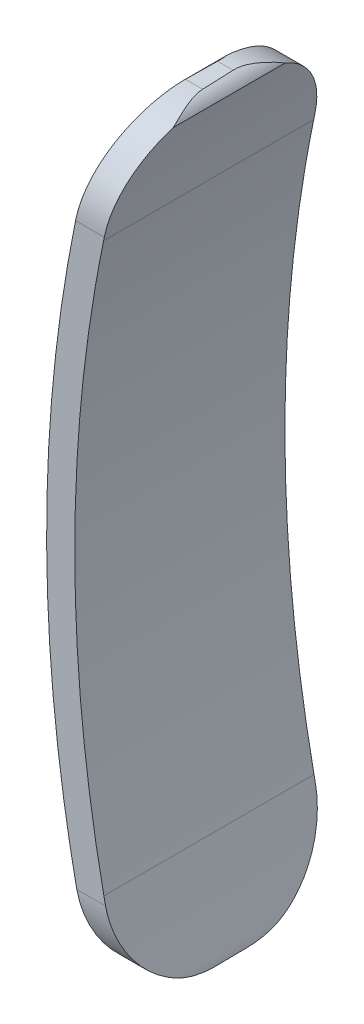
ISO-10303-21;
HEADER;
FILE_DESCRIPTION(('STEP AP214'),'2;1');
FILE_NAME('part.step','',(''),(''),'','','');
FILE_SCHEMA(('AUTOMOTIVE_DESIGN { 1 0 10303 214 1 1 1 1 }'));
ENDSEC;
DATA;
#1=APPLICATION_CONTEXT('core data for automotive mechanical design processes');
#2=APPLICATION_PROTOCOL_DEFINITION('international standard','automotive_design',2000,#1);
#3=PRODUCT_CONTEXT('',#1,'mechanical');
#4=PRODUCT('Part','Part','',(#3));
#5=PRODUCT_RELATED_PRODUCT_CATEGORY('part','',(#4));
#6=PRODUCT_DEFINITION_FORMATION('','',#4);
#7=PRODUCT_DEFINITION_CONTEXT('part definition',#1,'design');
#8=PRODUCT_DEFINITION('design','',#6,#7);
#9=PRODUCT_DEFINITION_SHAPE('','',#8);
#10=(LENGTH_UNIT() NAMED_UNIT(*) SI_UNIT(.MILLI.,.METRE.));
#11=(NAMED_UNIT(*) PLANE_ANGLE_UNIT() SI_UNIT($,.RADIAN.));
#12=(NAMED_UNIT(*) SI_UNIT($,.STERADIAN.) SOLID_ANGLE_UNIT());
#13=UNCERTAINTY_MEASURE_WITH_UNIT(LENGTH_MEASURE(1.E-05),#10,'distance_accuracy_value','');
#14=(GEOMETRIC_REPRESENTATION_CONTEXT(3) GLOBAL_UNCERTAINTY_ASSIGNED_CONTEXT((#13)) GLOBAL_UNIT_ASSIGNED_CONTEXT((#10,
#11,#12)) REPRESENTATION_CONTEXT('',''));
#15=CARTESIAN_POINT('',(0.,0.,0.));
#16=DIRECTION('',(0.,0.,1.));
#17=DIRECTION('',(1.,0.,0.));
#18=AXIS2_PLACEMENT_3D('',#15,#16,#17);
#19=CARTESIAN_POINT('',(-2.82263612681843,104.636798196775,25.4));
#20=DIRECTION('',(0.,0.,-1.));
#21=DIRECTION('',(-1.,0.,0.));
#22=AXIS2_PLACEMENT_3D('',#19,#20,#21);
#23=CYLINDRICAL_SURFACE('',#22,2.82842712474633);
#24=CARTESIAN_POINT('',(-0.281352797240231,105.878522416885,8.0406694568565));
#25=CARTESIAN_POINT('',(-0.312167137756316,105.941583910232,7.91157921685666));
#26=CARTESIAN_POINT('',(-0.344750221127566,106.002321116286,7.78179289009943));
#27=CARTESIAN_POINT('',(-0.41283781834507,106.119176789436,7.52086348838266));
#28=CARTESIAN_POINT('',(-0.448343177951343,106.175293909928,7.38972003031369));
#29=CARTESIAN_POINT('',(-0.521659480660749,106.282930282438,7.12611914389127));
#30=CARTESIAN_POINT('',(-0.559471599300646,106.334447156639,6.99366107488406));
#31=CARTESIAN_POINT('',(-0.636848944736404,106.432976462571,6.72750711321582));
#32=CARTESIAN_POINT('',(-0.676415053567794,106.479986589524,6.59381062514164));
#33=CARTESIAN_POINT('',(-0.756635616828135,106.569479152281,6.32518254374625));
#34=CARTESIAN_POINT('',(-0.79729042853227,106.611960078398,6.19025055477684));
#35=CARTESIAN_POINT('',(-0.878062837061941,106.691493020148,5.92231636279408));
#36=CARTESIAN_POINT('',(-0.918171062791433,106.728647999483,5.78934186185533));
#37=CARTESIAN_POINT('',(-0.998053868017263,106.798676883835,5.52220936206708));
#38=CARTESIAN_POINT('',(-1.03782852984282,106.83155187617,5.38805167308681));
#39=CARTESIAN_POINT('',(-1.11620502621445,106.893027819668,5.11850001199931));
#40=CARTESIAN_POINT('',(-1.15480747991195,106.92163105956,4.98310674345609));
#41=CARTESIAN_POINT('',(-1.22987921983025,106.974581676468,4.71099911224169));
#42=CARTESIAN_POINT('',(-1.26634989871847,106.99893185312,4.57428568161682));
#43=CARTESIAN_POINT('',(-1.33589728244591,107.043311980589,4.29933713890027));
#44=CARTESIAN_POINT('',(-1.36897521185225,107.063343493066,4.161102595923));
#45=CARTESIAN_POINT('',(-1.41728494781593,107.091469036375,3.94173437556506));
#46=CARTESIAN_POINT('',(-1.43415279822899,107.101031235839,3.86114732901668));
#47=CARTESIAN_POINT('',(-1.46591962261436,107.118662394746,3.6994387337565));
#48=CARTESIAN_POINT('',(-1.48081903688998,107.126731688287,3.61831730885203));
#49=CARTESIAN_POINT('',(-1.50831302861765,107.141353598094,3.45557504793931));
#50=CARTESIAN_POINT('',(-1.52090840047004,107.147906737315,3.37395439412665));
#51=CARTESIAN_POINT('',(-1.54356359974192,107.159522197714,3.20960062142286));
#52=CARTESIAN_POINT('',(-1.55360287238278,107.164572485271,3.12686379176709));
#53=CARTESIAN_POINT('',(-1.57071865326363,107.173094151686,2.96095761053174));
#54=CARTESIAN_POINT('',(-1.57779367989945,107.176564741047,2.87778806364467));
#55=CARTESIAN_POINT('',(-1.58877865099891,107.181915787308,2.71106468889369));
#56=CARTESIAN_POINT('',(-1.59268381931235,107.183793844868,2.62751047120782));
#57=CARTESIAN_POINT('',(-1.59489541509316,107.184866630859,2.54389291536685));
#58=B_SPLINE_CURVE_WITH_KNOTS('',3,(#24,#25,#26,#27,#28,#29,#30,#31,#32,#33,#34,#35,#36,#37,#38,
#39,#40,#41,#42,#43,#44,#45,#46,#47,#48,#49,#50,#51,#52,#53,#54,#55,#56,#57),.UNSPECIFIED.,.F.,
.F.,(4,2,2,2,2,2,2,2,2,2,2,2,2,2,2,2,4),(0.,0.44075970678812,0.881647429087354,1.32276173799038,
1.76410044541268,2.20558580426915,2.63684428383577,3.06799298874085,3.49890985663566,
3.92954198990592,4.36001814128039,4.60864684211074,4.85721983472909,5.10570696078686,
5.35613330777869,5.60668467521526,5.85761286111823),.UNSPECIFIED.);
#59=CARTESIAN_POINT('',(-0.281352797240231,105.878522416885,8.0406694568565));
#60=VERTEX_POINT('',#59);
#61=CARTESIAN_POINT('',(-1.59489541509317,107.184866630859,2.54389291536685));
#62=VERTEX_POINT('',#61);
#63=EDGE_CURVE('E497',#60,#62,#58,.T.);
#64=ORIENTED_EDGE('',*,*,#63,.F.);
#65=DIRECTION('',(0.,0.,-1.));
#66=VECTOR('',#65,1.);
#67=CARTESIAN_POINT('',(-0.281352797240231,105.878522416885,25.4));
#68=LINE('',#67,#66);
#69=CARTESIAN_POINT('',(-0.281352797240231,105.878522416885,-7.84383099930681));
#70=VERTEX_POINT('',#69);
#71=EDGE_CURVE('E224',#60,#70,#68,.T.);
#72=ORIENTED_EDGE('',*,*,#71,.T.);
#73=CARTESIAN_POINT('',(-1.72128493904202,107.241990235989,-1.900740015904));
#74=CARTESIAN_POINT('',(-1.72375015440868,107.243023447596,-1.98094675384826));
#75=CARTESIAN_POINT('',(-1.72442758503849,107.243314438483,-2.06121511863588));
#76=CARTESIAN_POINT('',(-1.72228204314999,107.242414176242,-2.22140350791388));
#77=CARTESIAN_POINT('',(-1.71947186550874,107.241228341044,-2.30132373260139));
#78=CARTESIAN_POINT('',(-1.71045220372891,107.237387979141,-2.4607748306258));
#79=CARTESIAN_POINT('',(-1.70424949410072,107.234736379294,-2.54030616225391));
#80=CARTESIAN_POINT('',(-1.68869196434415,107.227983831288,-2.6989478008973));
#81=CARTESIAN_POINT('',(-1.67933897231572,107.223883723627,-2.77805832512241));
#82=CARTESIAN_POINT('',(-1.65791239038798,107.214307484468,-2.9349541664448));
#83=CARTESIAN_POINT('',(-1.64586907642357,107.208846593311,-3.0127445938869));
#84=CARTESIAN_POINT('',(-1.61935134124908,107.196548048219,-3.16785339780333));
#85=CARTESIAN_POINT('',(-1.60487521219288,107.189709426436,-3.24517140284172));
#86=CARTESIAN_POINT('',(-1.57384995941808,107.17467722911,-3.39931235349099));
#87=CARTESIAN_POINT('',(-1.55729937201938,107.166482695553,-3.47613490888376));
#88=CARTESIAN_POINT('',(-1.52247487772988,107.148762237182,-3.62925931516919));
#89=CARTESIAN_POINT('',(-1.50420036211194,107.139235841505,-3.70556097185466));
#90=CARTESIAN_POINT('',(-1.45021076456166,107.110261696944,-3.92195243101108));
#91=CARTESIAN_POINT('',(-1.41281676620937,107.0892370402,-4.06141394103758));
#92=CARTESIAN_POINT('',(-1.33500285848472,107.042833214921,-4.33874782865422));
#93=CARTESIAN_POINT('',(-1.29458279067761,107.017453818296,-4.47662012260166));
#94=CARTESIAN_POINT('',(-1.21192793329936,106.962327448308,-4.75098779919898));
#95=CARTESIAN_POINT('',(-1.16969255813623,106.932579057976,-4.88748271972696));
#96=CARTESIAN_POINT('',(-1.08444415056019,106.868731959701,-5.15924256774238));
#97=CARTESIAN_POINT('',(-1.04143092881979,106.834632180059,-5.29450718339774));
#98=CARTESIAN_POINT('',(-0.955426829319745,106.762050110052,-5.56387211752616));
#99=CARTESIAN_POINT('',(-0.91243595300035,106.723567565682,-5.69797236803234));
#100=CARTESIAN_POINT('',(-0.826022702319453,106.641093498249,-5.96867743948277));
#101=CARTESIAN_POINT('',(-0.782620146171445,106.59698105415,-6.10525180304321));
#102=CARTESIAN_POINT('',(-0.697237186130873,106.504058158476,-6.37721275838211));
#103=CARTESIAN_POINT('',(-0.655256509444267,106.455248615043,-6.51259957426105));
#104=CARTESIAN_POINT('',(-0.573343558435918,106.352892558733,-6.78217776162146));
#105=CARTESIAN_POINT('',(-0.533411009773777,106.299346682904,-6.91636929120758));
#106=CARTESIAN_POINT('',(-0.456179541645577,106.187445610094,-7.18352835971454));
#107=CARTESIAN_POINT('',(-0.418880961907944,106.129089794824,-7.31649573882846));
#108=CARTESIAN_POINT('',(-0.347522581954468,106.00748408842,-7.58116431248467));
#109=CARTESIAN_POINT('',(-0.313464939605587,105.944230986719,-7.71286461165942));
#110=CARTESIAN_POINT('',(-0.281352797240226,105.878522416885,-7.84383099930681));
#111=B_SPLINE_CURVE_WITH_KNOTS('',3,(#73,#74,#75,#76,#77,#78,#79,#80,#81,#82,#83,#84,#85,#86,
#87,#88,#89,#90,#91,#92,#93,#94,#95,#96,#97,#98,#99,#100,#101,#102,#103,#104,#105,#106,#107,
#108,#109,#110),.UNSPECIFIED.,.F.,.F.,(4,2,2,2,2,2,2,2,2,2,2,2,2,2,2,2,2,2,4),(0.,
0.240726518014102,0.480572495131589,0.719941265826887,0.959171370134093,1.19583395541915,
1.43266337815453,1.66966085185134,1.90674232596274,2.34433208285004,2.78194476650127,
3.21969969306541,3.65756264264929,4.09545098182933,4.54519198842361,4.99484621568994,
5.4444400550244,5.89409177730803,6.34404082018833),.UNSPECIFIED.);
#112=CARTESIAN_POINT('',(-1.72128493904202,107.241990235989,-1.900740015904));
#113=VERTEX_POINT('',#112);
#114=EDGE_CURVE('E453',#113,#70,#111,.T.);
#115=ORIENTED_EDGE('',*,*,#114,.F.);
#116=CARTESIAN_POINT('',(-2.82263612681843,104.636798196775,200.802193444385));
#117=DIRECTION('',(0.,0.999917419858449,0.0128512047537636));
#118=DIRECTION('',(0.,0.0128512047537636,-0.999917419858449));
#119=AXIS2_PLACEMENT_3D('',#116,#117,#118);
#120=ELLIPSE('',#119,220.090425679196,2.82842712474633);
#121=EDGE_CURVE('E455',#62,#113,#120,.T.);
#122=ORIENTED_EDGE('',*,*,#121,.F.);
#123=EDGE_LOOP('',(#64,#72,#115,#122));
#124=FACE_BOUND('',#123,.T.);
#125=ADVANCED_FACE('F32',(#124),#23,.T.);
#126=CARTESIAN_POINT('',(-3.13372094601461,94.0420672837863,25.4));
#127=CARTESIAN_POINT('',(-2.98860807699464,94.7467274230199,25.4));
#128=CARTESIAN_POINT('',(-2.68757225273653,96.1673342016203,25.4));
#129=CARTESIAN_POINT('',(-2.07634193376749,98.8982782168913,25.4));
#130=CARTESIAN_POINT('',(-1.47841045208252,101.368657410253,25.4));
#131=CARTESIAN_POINT('',(-0.970117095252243,103.350138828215,25.4));
#132=CARTESIAN_POINT('',(-0.648308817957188,104.56094707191,25.4));
#133=CARTESIAN_POINT('',(-0.449361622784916,105.286135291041,25.4));
#134=CARTESIAN_POINT('',(-0.332172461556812,105.70261401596,25.4));
#135=CARTESIAN_POINT('',(-0.300885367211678,105.811716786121,25.4));
#136=CARTESIAN_POINT('',(-0.281352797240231,105.878522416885,25.4));
#137=B_SPLINE_CURVE_WITH_KNOTS('',3,(#126,#127,#128,#129,#130,#131,#132,#133,#134,#135,#136),
.UNSPECIFIED.,.F.,.F.,(4,1,1,1,1,1,1,1,4),(0.,0.110632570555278,0.221265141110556,
0.442530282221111,0.553162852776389,0.663795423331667,0.774427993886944,0.829744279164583,
0.885060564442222),.UNSPECIFIED.);
#138=DIRECTION('',(0.,0.,-1.));
#139=VECTOR('',#138,1.);
#140=SURFACE_OF_LINEAR_EXTRUSION('',#137,#139);
#141=CARTESIAN_POINT('',(-3.13372094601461,94.0420672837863,15.0822882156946));
#142=CARTESIAN_POINT('',(-2.98860807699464,94.7467274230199,15.0822882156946));
#143=CARTESIAN_POINT('',(-2.68757225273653,96.1673342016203,15.0822882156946));
#144=CARTESIAN_POINT('',(-2.07634193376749,98.8982782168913,15.0822882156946));
#145=CARTESIAN_POINT('',(-1.47841045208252,101.368657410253,15.0822882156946));
#146=CARTESIAN_POINT('',(-0.970117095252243,103.350138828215,15.0822882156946));
#147=CARTESIAN_POINT('',(-0.648308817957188,104.56094707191,15.0822882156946));
#148=CARTESIAN_POINT('',(-0.449361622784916,105.286135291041,15.0822882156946));
#149=CARTESIAN_POINT('',(-0.332172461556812,105.70261401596,15.0822882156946));
#150=CARTESIAN_POINT('',(-0.300885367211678,105.811716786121,15.0822882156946));
#151=CARTESIAN_POINT('',(-0.281352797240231,105.878522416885,15.0822882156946));
#152=B_SPLINE_CURVE_WITH_KNOTS('',3,(#141,#142,#143,#144,#145,#146,#147,#148,#149,#150,#151),
.UNSPECIFIED.,.F.,.F.,(4,1,1,1,1,1,1,1,4),(0.,0.110632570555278,0.221265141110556,
0.442530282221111,0.553162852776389,0.663795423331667,0.774427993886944,0.829744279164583,
0.885060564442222),.UNSPECIFIED.);
#153=CARTESIAN_POINT('',(-3.13372094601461,94.0420672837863,15.0822882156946));
#154=VERTEX_POINT('',#153);
#155=CARTESIAN_POINT('',(-3.03272611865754,94.5292343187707,15.0822882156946));
#156=VERTEX_POINT('',#155);
#157=EDGE_CURVE('E173',#154,#156,#152,.T.);
#158=ORIENTED_EDGE('',*,*,#157,.F.);
#159=DIRECTION('',(0.,0.,-1.));
#160=VECTOR('',#159,1.);
#161=CARTESIAN_POINT('',(-3.13372094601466,94.0420672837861,25.4));
#162=LINE('',#161,#160);
#163=CARTESIAN_POINT('',(-3.13372094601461,94.0420672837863,-14.7602471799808));
#164=VERTEX_POINT('',#163);
#165=EDGE_CURVE('E460',#154,#164,#162,.T.);
#166=ORIENTED_EDGE('',*,*,#165,.T.);
#167=CARTESIAN_POINT('',(-3.13372094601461,94.0420672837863,-14.7602471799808));
#168=CARTESIAN_POINT('',(-2.98860807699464,94.7467274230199,-14.7602471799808));
#169=CARTESIAN_POINT('',(-2.68757225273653,96.1673342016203,-14.7602471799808));
#170=CARTESIAN_POINT('',(-2.07634193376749,98.8982782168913,-14.7602471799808));
#171=CARTESIAN_POINT('',(-1.47841045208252,101.368657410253,-14.7602471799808));
#172=CARTESIAN_POINT('',(-0.970117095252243,103.350138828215,-14.7602471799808));
#173=CARTESIAN_POINT('',(-0.648308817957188,104.56094707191,-14.7602471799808));
#174=CARTESIAN_POINT('',(-0.449361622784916,105.286135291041,-14.7602471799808));
#175=CARTESIAN_POINT('',(-0.332172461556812,105.70261401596,-14.7602471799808));
#176=CARTESIAN_POINT('',(-0.300885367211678,105.811716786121,-14.7602471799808));
#177=CARTESIAN_POINT('',(-0.281352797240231,105.878522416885,-14.7602471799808));
#178=B_SPLINE_CURVE_WITH_KNOTS('',3,(#167,#168,#169,#170,#171,#172,#173,#174,#175,#176,#177),
.UNSPECIFIED.,.F.,.F.,(4,1,1,1,1,1,1,1,4),(0.,0.110632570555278,0.221265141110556,
0.442530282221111,0.553162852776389,0.663795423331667,0.774427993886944,0.829744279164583,
0.885060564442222),.UNSPECIFIED.);
#179=CARTESIAN_POINT('',(-2.95227879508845,94.9127785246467,-14.7602471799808));
#180=VERTEX_POINT('',#179);
#181=EDGE_CURVE('E519',#180,#164,#178,.F.);
#182=ORIENTED_EDGE('',*,*,#181,.F.);
#183=CARTESIAN_POINT('',(-0.281352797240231,105.878522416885,-7.84383099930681));
#184=CARTESIAN_POINT('',(-0.289767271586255,105.849823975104,-7.90104457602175));
#185=CARTESIAN_POINT('',(-0.298206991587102,105.820691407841,-7.95803563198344));
#186=CARTESIAN_POINT('',(-0.315195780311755,105.761573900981,-8.07155719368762));
#187=CARTESIAN_POINT('',(-0.32374484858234,105.731588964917,-8.12808770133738));
#188=CARTESIAN_POINT('',(-0.349643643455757,105.640381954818,-8.29696048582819));
#189=CARTESIAN_POINT('',(-0.367245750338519,105.577904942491,-8.40858947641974));
#190=CARTESIAN_POINT('',(-0.403191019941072,105.449714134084,-8.62982221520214));
#191=CARTESIAN_POINT('',(-0.421534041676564,105.384000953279,-8.73942634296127));
#192=CARTESIAN_POINT('',(-0.458926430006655,105.249340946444,-8.95650562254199));
#193=CARTESIAN_POINT('',(-0.477975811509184,105.180394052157,-9.06398072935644));
#194=CARTESIAN_POINT('',(-0.536199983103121,104.968724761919,-9.38329086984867));
#195=CARTESIAN_POINT('',(-0.57642184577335,104.82127705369,-9.59183259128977));
#196=CARTESIAN_POINT('',(-0.65954858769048,104.514229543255,-9.99926070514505));
#197=CARTESIAN_POINT('',(-0.702453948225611,104.354627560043,-10.1981453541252));
#198=CARTESIAN_POINT('',(-0.777512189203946,104.073430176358,-10.527532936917));
#199=CARTESIAN_POINT('',(-0.809039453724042,103.954757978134,-10.6606851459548));
#200=CARTESIAN_POINT('',(-0.873201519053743,103.712036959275,-10.9217215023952));
#201=CARTESIAN_POINT('',(-0.905836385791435,103.587987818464,-11.0496053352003));
#202=CARTESIAN_POINT('',(-1.00528947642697,103.208031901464,-11.4249749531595));
#203=CARTESIAN_POINT('',(-1.07366450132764,102.944285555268,-11.6642152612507));
#204=CARTESIAN_POINT('',(-1.21382445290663,102.397746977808,-12.1190586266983));
#205=CARTESIAN_POINT('',(-1.28561175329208,102.114941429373,-12.3346448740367));
#206=CARTESIAN_POINT('',(-1.43180150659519,101.532430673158,-12.7406838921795));
#207=CARTESIAN_POINT('',(-1.50620371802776,101.232727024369,-12.9311389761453));
#208=CARTESIAN_POINT('',(-1.61931102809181,100.771886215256,-13.1969098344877));
#209=CARTESIAN_POINT('',(-1.65729430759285,100.61626608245,-13.2822401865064));
#210=CARTESIAN_POINT('',(-1.73366340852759,100.301572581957,-13.4460704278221));
#211=CARTESIAN_POINT('',(-1.77204919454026,100.142499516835,-13.5245709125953));
#212=CARTESIAN_POINT('',(-1.8491347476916,99.8211722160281,-13.6746840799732));
#213=CARTESIAN_POINT('',(-1.88783457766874,99.6589173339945,-13.7462953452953));
#214=CARTESIAN_POINT('',(-1.96545060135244,99.3315327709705,-13.8824381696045));
#215=CARTESIAN_POINT('',(-2.0043667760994,99.1664033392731,-13.9469703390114));
#216=CARTESIAN_POINT('',(-2.08228709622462,98.8337102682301,-14.0688598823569));
#217=CARTESIAN_POINT('',(-2.12129113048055,98.6661489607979,-14.1262236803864));
#218=CARTESIAN_POINT('',(-2.19932849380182,98.3287295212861,-14.2336552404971));
#219=CARTESIAN_POINT('',(-2.23836182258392,98.1588714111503,-14.2837230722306));
#220=CARTESIAN_POINT('',(-2.35535216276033,97.6463921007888,-14.4228559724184));
#221=CARTESIAN_POINT('',(-2.43324568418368,97.3006690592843,-14.5009225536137));
#222=CARTESIAN_POINT('',(-2.54809628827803,96.7840163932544,-14.5945146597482));
#223=CARTESIAN_POINT('',(-2.58539554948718,96.6151352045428,-14.6215067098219));
#224=CARTESIAN_POINT('',(-2.6597302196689,96.2763354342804,-14.6684192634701));
#225=CARTESIAN_POINT('',(-2.69676565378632,96.1064169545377,-14.6883404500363));
#226=CARTESIAN_POINT('',(-2.77043893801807,95.7661468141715,-14.7210387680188));
#227=CARTESIAN_POINT('',(-2.80707739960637,95.5957965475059,-14.7338291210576));
#228=CARTESIAN_POINT('',(-2.87997754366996,95.2545880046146,-14.7523399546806));
#229=CARTESIAN_POINT('',(-2.91623913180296,95.0837296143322,-14.7580587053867));
#230=CARTESIAN_POINT('',(-2.95227879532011,94.9127785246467,-14.7602471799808));
#231=B_SPLINE_CURVE_WITH_KNOTS('',3,(#183,#184,#185,#186,#187,#188,#189,#190,#191,#192,#193,
#194,#195,#196,#197,#198,#199,#200,#201,#202,#203,#204,#205,#206,#207,#208,#209,#210,#211,#212,
#213,#214,#215,#216,#217,#218,#219,#220,#221,#222,#223,#224,#225,#226,#227,#228,#229,#230),
.UNSPECIFIED.,.F.,.F.,(4,2,2,2,2,2,2,2,2,2,2,2,2,2,2,2,2,2,2,2,2,2,2,4),(0.,0.19367174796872,
0.387342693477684,0.774666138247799,1.16191622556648,1.54917449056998,2.32431381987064,
3.09959257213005,3.6428122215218,4.18606426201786,5.27242307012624,6.35954897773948,
7.44657475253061,7.99093643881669,8.53525061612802,9.07967653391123,9.6240554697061,
10.1679429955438,10.7118253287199,11.7989479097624,12.323976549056,12.8489544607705,
13.3729557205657,13.8970851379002),.UNSPECIFIED.);
#232=EDGE_CURVE('E239',#70,#180,#231,.T.);
#233=ORIENTED_EDGE('',*,*,#232,.F.);
#234=ORIENTED_EDGE('',*,*,#71,.F.);
#235=CARTESIAN_POINT('',(-3.03272611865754,94.5292343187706,15.0822882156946));
#236=CARTESIAN_POINT('',(-2.99558856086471,94.7071965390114,15.084585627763));
#237=CARTESIAN_POINT('',(-2.95818762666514,94.8851546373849,15.0830537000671));
#238=CARTESIAN_POINT('',(-2.88293007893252,95.2407390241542,15.0723113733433));
#239=CARTESIAN_POINT('',(-2.84507347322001,95.4183653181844,15.0631011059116));
#240=CARTESIAN_POINT('',(-2.76897706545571,95.7729561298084,15.036983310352));
#241=CARTESIAN_POINT('',(-2.73073729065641,95.949920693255,15.0200763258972));
#242=CARTESIAN_POINT('',(-2.65393680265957,96.3028804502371,14.978610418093));
#243=CARTESIAN_POINT('',(-2.61537608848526,96.4788756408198,14.9540514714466));
#244=CARTESIAN_POINT('',(-2.5380477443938,96.8294190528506,14.897429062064));
#245=CARTESIAN_POINT('',(-2.49928036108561,97.0039685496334,14.8653731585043));
#246=CARTESIAN_POINT('',(-2.42157987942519,97.3514853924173,14.7937635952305));
#247=CARTESIAN_POINT('',(-2.38264678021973,97.5244527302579,14.7542098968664));
#248=CARTESIAN_POINT('',(-2.30468917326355,97.8685150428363,14.6677280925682));
#249=CARTESIAN_POINT('',(-2.26566466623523,98.0396100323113,14.6208000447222));
#250=CARTESIAN_POINT('',(-2.18760841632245,98.3795989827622,14.5195993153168));
#251=CARTESIAN_POINT('',(-2.14857667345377,98.548492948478,14.4653266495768));
#252=CARTESIAN_POINT('',(-2.03159550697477,99.0515107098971,14.2916467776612));
#253=CARTESIAN_POINT('',(-1.95375717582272,99.3819834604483,14.161374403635));
#254=CARTESIAN_POINT('',(-1.79916995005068,100.0306890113,13.8728293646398));
#255=CARTESIAN_POINT('',(-1.72242107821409,100.348921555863,13.7145561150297));
#256=CARTESIAN_POINT('',(-1.57070506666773,100.971071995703,13.3710374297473));
#257=CARTESIAN_POINT('',(-1.4957384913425,101.274985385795,13.1857835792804));
#258=CARTESIAN_POINT('',(-1.34827561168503,101.866311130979,12.7897415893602));
#259=CARTESIAN_POINT('',(-1.27577920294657,102.153724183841,12.5789545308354));
#260=CARTESIAN_POINT('',(-1.1338166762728,102.710706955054,12.1323456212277));
#261=CARTESIAN_POINT('',(-1.06436052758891,102.980219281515,11.8964490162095));
#262=CARTESIAN_POINT('',(-0.929418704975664,103.498745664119,11.4019941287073));
#263=CARTESIAN_POINT('',(-0.86393359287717,103.747756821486,11.143432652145));
#264=CARTESIAN_POINT('',(-0.737805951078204,104.222948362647,10.6057132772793));
#265=CARTESIAN_POINT('',(-0.677156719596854,104.449160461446,10.3265849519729));
#266=CARTESIAN_POINT('',(-0.561203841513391,104.877516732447,9.74953972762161));
#267=CARTESIAN_POINT('',(-0.505897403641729,105.07967348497,9.4516327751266));
#268=CARTESIAN_POINT('',(-0.438130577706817,105.324304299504,9.05601832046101));
#269=CARTESIAN_POINT('',(-0.423053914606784,105.378515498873,8.96587215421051));
#270=CARTESIAN_POINT('',(-0.393394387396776,105.484707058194,8.78421346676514));
#271=CARTESIAN_POINT('',(-0.378811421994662,105.536687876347,8.69270123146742));
#272=CARTESIAN_POINT('',(-0.350205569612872,105.638308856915,8.50849841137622));
#273=CARTESIAN_POINT('',(-0.336181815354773,105.687952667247,8.4158099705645));
#274=CARTESIAN_POINT('',(-0.308516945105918,105.784960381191,8.22916638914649));
#275=CARTESIAN_POINT('',(-0.294875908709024,105.832323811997,8.13521099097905));
#276=CARTESIAN_POINT('',(-0.281352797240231,105.878522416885,8.04066945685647));
#277=B_SPLINE_CURVE_WITH_KNOTS('',3,(#235,#236,#237,#238,#239,#240,#241,#242,#243,#244,#245,
#246,#247,#248,#249,#250,#251,#252,#253,#254,#255,#256,#257,#258,#259,#260,#261,#262,#263,#264,
#265,#266,#267,#268,#269,#270,#271,#272,#273,#274,#275,#276),.UNSPECIFIED.,.F.,.F.,(4,2,2,2,2,2,
2,2,2,2,2,2,2,2,2,2,2,2,2,2,4),(0.,0.545392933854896,1.0907765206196,1.63612158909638,
2.18146831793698,2.72626752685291,3.27106954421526,3.81586727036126,4.36066382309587,
5.4502155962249,6.5397901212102,7.62970519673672,8.71957414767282,9.8127836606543,
10.9061474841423,11.9979687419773,13.0892164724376,13.407996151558,13.7267100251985,
14.0449086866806,14.3631730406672),.UNSPECIFIED.);
#278=EDGE_CURVE('E248',#156,#60,#277,.T.);
#279=ORIENTED_EDGE('',*,*,#278,.F.);
#280=EDGE_LOOP('',(#158,#166,#182,#233,#234,#279));
#281=FACE_BOUND('',#280,.T.);
#282=ADVANCED_FACE('F229',(#281),#140,.F.);
#283=CARTESIAN_POINT('',(-3.09340152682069,13.5025036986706,25.4));
#284=CARTESIAN_POINT('',(-4.46257612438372,20.1176076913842,25.4));
#285=CARTESIAN_POINT('',(-6.52872417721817,33.497166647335,25.4));
#286=CARTESIAN_POINT('',(-7.571275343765,53.7700542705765,25.4));
#287=CARTESIAN_POINT('',(-6.54902256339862,74.0439754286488,25.4));
#288=CARTESIAN_POINT('',(-4.49627161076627,87.42559592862,25.4));
#289=CARTESIAN_POINT('',(-3.13372094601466,94.0420672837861,25.4));
#290=B_SPLINE_CURVE_WITH_KNOTS('',3,(#283,#284,#285,#286,#287,#288,#289),.UNSPECIFIED.,.F.,.F.,
(4,1,1,1,4),(-0.203077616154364,-0.101288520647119,0.000500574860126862,0.102289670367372,
0.204078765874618),.UNSPECIFIED.);
#291=DIRECTION('',(0.,0.,-1.));
#292=VECTOR('',#291,1.);
#293=SURFACE_OF_LINEAR_EXTRUSION('',#290,#292);
#294=CARTESIAN_POINT('',(-3.09340152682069,13.5025036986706,15.0822882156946));
#295=CARTESIAN_POINT('',(-4.46257612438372,20.1176076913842,15.0822882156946));
#296=CARTESIAN_POINT('',(-6.52872417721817,33.497166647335,15.0822882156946));
#297=CARTESIAN_POINT('',(-7.571275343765,53.7700542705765,15.0822882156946));
#298=CARTESIAN_POINT('',(-6.54902256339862,74.0439754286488,15.0822882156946));
#299=CARTESIAN_POINT('',(-4.49627161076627,87.42559592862,15.0822882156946));
#300=CARTESIAN_POINT('',(-3.13372094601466,94.0420672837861,15.0822882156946));
#301=B_SPLINE_CURVE_WITH_KNOTS('',3,(#294,#295,#296,#297,#298,#299,#300),.UNSPECIFIED.,.F.,.F.,
(4,1,1,1,4),(-0.203077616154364,-0.101288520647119,0.000500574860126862,0.102289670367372,
0.204078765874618),.UNSPECIFIED.);
#302=CARTESIAN_POINT('',(-3.09340152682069,13.5025036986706,15.0822882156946));
#303=VERTEX_POINT('',#302);
#304=EDGE_CURVE('E322',#303,#154,#301,.T.);
#305=ORIENTED_EDGE('',*,*,#304,.F.);
#306=DIRECTION('',(0.,0.,-1.));
#307=VECTOR('',#306,1.);
#308=CARTESIAN_POINT('',(-3.09340152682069,13.5025036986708,25.4));
#309=LINE('',#308,#307);
#310=CARTESIAN_POINT('',(-3.09340152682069,13.5025036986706,-14.7602471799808));
#311=VERTEX_POINT('',#310);
#312=EDGE_CURVE('E457',#303,#311,#309,.T.);
#313=ORIENTED_EDGE('',*,*,#312,.T.);
#314=CARTESIAN_POINT('',(-3.09340152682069,13.5025036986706,-14.7602471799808));
#315=CARTESIAN_POINT('',(-4.46257612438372,20.1176076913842,-14.7602471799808));
#316=CARTESIAN_POINT('',(-6.52872417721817,33.497166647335,-14.7602471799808));
#317=CARTESIAN_POINT('',(-7.571275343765,53.7700542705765,-14.7602471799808));
#318=CARTESIAN_POINT('',(-6.54902256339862,74.0439754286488,-14.7602471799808));
#319=CARTESIAN_POINT('',(-4.49627161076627,87.42559592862,-14.7602471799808));
#320=CARTESIAN_POINT('',(-3.13372094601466,94.0420672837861,-14.7602471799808));
#321=B_SPLINE_CURVE_WITH_KNOTS('',3,(#314,#315,#316,#317,#318,#319,#320),.UNSPECIFIED.,.F.,.F.,
(4,1,1,1,4),(-0.203077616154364,-0.101288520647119,0.000500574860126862,0.102289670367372,
0.204078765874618),.UNSPECIFIED.);
#322=EDGE_CURVE('E399',#164,#311,#321,.F.);
#323=ORIENTED_EDGE('',*,*,#322,.F.);
#324=ORIENTED_EDGE('',*,*,#165,.F.);
#325=EDGE_LOOP('',(#305,#313,#323,#324));
#326=FACE_BOUND('',#325,.T.);
#327=ADVANCED_FACE('F195',(#326),#293,.F.);
#328=CARTESIAN_POINT('',(0.,1.22548656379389E-13,25.4));
#329=CARTESIAN_POINT('',(0.,0.0709860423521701,25.4));
#330=CARTESIAN_POINT('',(-0.00515889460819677,0.231389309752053,25.4));
#331=CARTESIAN_POINT('',(-0.019448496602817,0.404145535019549,25.4));
#332=CARTESIAN_POINT('',(-0.0367915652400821,0.548001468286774,25.4));
#333=CARTESIAN_POINT('',(-0.0527055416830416,0.650322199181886,25.4));
#334=CARTESIAN_POINT('',(-0.0692706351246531,0.745569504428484,25.4));
#335=CARTESIAN_POINT('',(-0.083745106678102,0.818157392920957,25.4));
#336=CARTESIAN_POINT('',(-0.100391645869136,0.896391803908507,25.4));
#337=CARTESIAN_POINT('',(-0.114893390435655,0.959261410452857,25.4));
#338=CARTESIAN_POINT('',(-0.129605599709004,1.02086930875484,25.4));
#339=CARTESIAN_POINT('',(-0.14384219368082,1.07878171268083,25.4));
#340=CARTESIAN_POINT('',(-0.16364948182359,1.15801679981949,25.4));
#341=CARTESIAN_POINT('',(-0.191373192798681,1.26696357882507,25.4));
#342=CARTESIAN_POINT('',(-0.23090048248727,1.42029836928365,25.4));
#343=CARTESIAN_POINT('',(-0.293074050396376,1.65979971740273,25.4));
#344=CARTESIAN_POINT('',(-0.389470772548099,2.02928610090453,25.4));
#345=CARTESIAN_POINT('',(-0.53052595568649,2.57064054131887,25.4));
#346=CARTESIAN_POINT('',(-0.75219382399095,3.42701912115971,25.4));
#347=CARTESIAN_POINT('',(-1.08830860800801,4.7445587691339,25.4));
#348=CARTESIAN_POINT('',(-1.55385813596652,6.6297435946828,25.4));
#349=CARTESIAN_POINT('',(-2.0602627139,8.76735526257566,25.4));
#350=CARTESIAN_POINT('',(-2.58227075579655,11.0819235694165,25.4));
#351=CARTESIAN_POINT('',(-2.92750634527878,12.7009887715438,25.4));
#352=CARTESIAN_POINT('',(-3.09340152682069,13.5025036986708,25.4));
#353=B_SPLINE_CURVE_WITH_KNOTS('',3,(#328,#329,#330,#331,#332,#333,#334,#335,#336,#337,#338,
#339,#340,#341,#342,#343,#344,#345,#346,#347,#348,#349,#350,#351,#352),.UNSPECIFIED.,.F.,.F.,(4,
1,1,1,1,1,1,1,1,1,1,1,1,1,1,1,1,1,1,1,1,1,4),(0.,0.001953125,0.00390625,0.0078125,0.01171875,
0.015625,0.0234375,0.03125,0.046875,0.0625,0.078125,0.09375,0.125,0.15625,0.1875,0.25,0.3125,
0.375,0.5,0.625,0.75,0.875,1.),.UNSPECIFIED.);
#354=DIRECTION('',(0.,0.,-1.));
#355=VECTOR('',#354,1.);
#356=SURFACE_OF_LINEAR_EXTRUSION('',#353,#355);
#357=CARTESIAN_POINT('',(0.,1.225454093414E-13,2.55115411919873));
#358=CARTESIAN_POINT('',(-1.67900320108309E-05,0.00228031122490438,2.72893961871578));
#359=CARTESIAN_POINT('',(-9.34835456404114E-07,0.00830139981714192,2.90667874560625));
#360=CARTESIAN_POINT('',(-0.000105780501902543,0.0278302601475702,3.26191819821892));
#361=CARTESIAN_POINT('',(-0.000226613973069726,0.0413452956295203,3.43941812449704));
#362=CARTESIAN_POINT('',(-0.000807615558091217,0.0758734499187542,3.79379655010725));
#363=CARTESIAN_POINT('',(-0.00126799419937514,0.0968912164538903,3.97067459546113));
#364=CARTESIAN_POINT('',(-0.00276609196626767,0.146360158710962,4.32344137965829));
#365=CARTESIAN_POINT('',(-0.00380397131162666,0.174813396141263,4.49932983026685));
#366=CARTESIAN_POINT('',(-0.00613614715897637,0.222859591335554,4.76152971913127));
#367=CARTESIAN_POINT('',(-0.00703828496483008,0.239701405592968,4.84835750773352));
#368=CARTESIAN_POINT('',(-0.00924754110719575,0.275187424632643,5.02164040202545));
#369=CARTESIAN_POINT('',(-0.0105546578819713,0.293831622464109,5.10809550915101));
#370=CARTESIAN_POINT('',(-0.013699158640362,0.332910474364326,5.28055991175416));
#371=CARTESIAN_POINT('',(-0.0155363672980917,0.353344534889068,5.3665693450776));
#372=CARTESIAN_POINT('',(-0.0196257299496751,0.396002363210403,5.53813388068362));
#373=CARTESIAN_POINT('',(-0.0218778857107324,0.418226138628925,5.62368898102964));
#374=CARTESIAN_POINT('',(-0.0269644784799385,0.464441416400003,5.7942586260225));
#375=CARTESIAN_POINT('',(-0.0297986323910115,0.488432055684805,5.87927341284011));
#376=CARTESIAN_POINT('',(-0.0361425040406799,0.538176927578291,6.04876034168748));
#377=CARTESIAN_POINT('',(-0.0396522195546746,0.563931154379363,6.13323248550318));
#378=CARTESIAN_POINT('',(-0.0475567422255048,0.617170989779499,6.30154239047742));
#379=CARTESIAN_POINT('',(-0.0519511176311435,0.644655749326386,6.38538044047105));
#380=CARTESIAN_POINT('',(-0.0615390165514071,0.701349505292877,6.55242566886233));
#381=CARTESIAN_POINT('',(-0.066732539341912,0.73055850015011,6.63563284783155));
#382=CARTESIAN_POINT('',(-0.0780752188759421,0.789940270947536,6.79934184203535));
#383=CARTESIAN_POINT('',(-0.0841980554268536,0.820072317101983,6.87986022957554));
#384=CARTESIAN_POINT('',(-0.0940446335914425,0.866463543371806,7.00012143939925));
#385=CARTESIAN_POINT('',(-0.0974372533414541,0.882126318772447,7.04012287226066));
#386=CARTESIAN_POINT('',(-0.104489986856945,0.913844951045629,7.11994590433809));
#387=CARTESIAN_POINT('',(-0.108150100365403,0.929900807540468,7.15976750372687));
#388=CARTESIAN_POINT('',(-0.119465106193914,0.97865511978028,7.27895076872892));
#389=CARTESIAN_POINT('',(-0.127455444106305,1.0119439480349,7.35804031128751));
#390=CARTESIAN_POINT('',(-0.144150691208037,1.08008234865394,7.51546577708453));
#391=CARTESIAN_POINT('',(-0.152855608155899,1.11493193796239,7.59380169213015));
#392=CARTESIAN_POINT('',(-0.179816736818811,1.22184752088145,7.8277526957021));
#393=CARTESIAN_POINT('',(-0.198910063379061,1.29624204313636,7.98221747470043));
#394=CARTESIAN_POINT('',(-0.238893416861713,1.45111015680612,8.28784681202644));
#395=CARTESIAN_POINT('',(-0.259783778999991,1.53158488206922,8.43901074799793));
#396=CARTESIAN_POINT('',(-0.325371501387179,1.78373032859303,8.89059868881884));
#397=CARTESIAN_POINT('',(-0.372574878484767,1.96452906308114,9.1856351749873));
#398=CARTESIAN_POINT('',(-0.472740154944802,2.34888219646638,9.7595469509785));
#399=CARTESIAN_POINT('',(-0.525704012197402,2.5524443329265,10.0384166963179));
#400=CARTESIAN_POINT('',(-0.636810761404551,2.98130597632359,10.5784772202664));
#401=CARTESIAN_POINT('',(-0.694960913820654,3.2066359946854,10.8396422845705));
#402=CARTESIAN_POINT('',(-0.815643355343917,3.67696670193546,11.3424833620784));
#403=CARTESIAN_POINT('',(-0.878175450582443,3.92196652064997,11.5841602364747));
#404=CARTESIAN_POINT('',(-1.009385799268,4.43959086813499,12.0551043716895));
#405=CARTESIAN_POINT('',(-1.07820617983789,4.71290414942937,12.2835750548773));
#406=CARTESIAN_POINT('',(-1.21912842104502,5.27718660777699,12.716519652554));
#407=CARTESIAN_POINT('',(-1.29123038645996,5.56815634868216,12.9209928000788));
#408=CARTESIAN_POINT('',(-1.4012588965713,6.01621496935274,13.2086047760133));
#409=CARTESIAN_POINT('',(-1.43824463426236,6.16748931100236,13.3012858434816));
#410=CARTESIAN_POINT('',(-1.51277052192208,6.47374037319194,13.4801079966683));
#411=CARTESIAN_POINT('',(-1.5503106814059,6.62871715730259,13.5662489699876));
#412=CARTESIAN_POINT('',(-1.62585471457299,6.94211571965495,13.7318340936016));
#413=CARTESIAN_POINT('',(-1.66385863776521,7.10053786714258,13.8112775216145));
#414=CARTESIAN_POINT('',(-1.74023243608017,7.42051046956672,13.9633676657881));
#415=CARTESIAN_POINT('',(-1.77860228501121,7.582060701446,14.0360148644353));
#416=CARTESIAN_POINT('',(-1.86012653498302,7.92708993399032,14.1824143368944));
#417=CARTESIAN_POINT('',(-1.90331645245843,8.11092680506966,14.2553051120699));
#418=CARTESIAN_POINT('',(-1.98992519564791,8.48180360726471,14.3922621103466));
#419=CARTESIAN_POINT('',(-2.03334402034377,8.66884352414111,14.4563283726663));
#420=CARTESIAN_POINT('',(-2.12029694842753,9.04577954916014,14.5753863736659));
#421=CARTESIAN_POINT('',(-2.16383105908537,9.23567584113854,14.6303775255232));
#422=CARTESIAN_POINT('',(-2.25089744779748,9.61790157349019,14.7311258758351));
#423=CARTESIAN_POINT('',(-2.29442972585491,9.8102310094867,14.7768830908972));
#424=CARTESIAN_POINT('',(-2.38150101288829,10.1974558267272,14.8592086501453));
#425=CARTESIAN_POINT('',(-2.4250396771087,10.3923570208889,14.8957500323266));
#426=CARTESIAN_POINT('',(-2.51188321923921,10.7837639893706,14.9592548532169));
#427=CARTESIAN_POINT('',(-2.55518810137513,10.9802697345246,14.9862184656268));
#428=CARTESIAN_POINT('',(-2.64146042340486,11.3744933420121,15.0304104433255));
#429=CARTESIAN_POINT('',(-2.68442778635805,11.5722114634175,15.0476366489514));
#430=CARTESIAN_POINT('',(-2.76992113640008,11.9683656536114,15.0723083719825));
#431=CARTESIAN_POINT('',(-2.81244709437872,12.1668017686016,15.0797532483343));
#432=CARTESIAN_POINT('',(-2.8547024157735,12.3653583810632,15.0822882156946));
#433=B_SPLINE_CURVE_WITH_KNOTS('',3,(#357,#358,#359,#360,#361,#362,#363,#364,#365,#366,#367,
#368,#369,#370,#371,#372,#373,#374,#375,#376,#377,#378,#379,#380,#381,#382,#383,#384,#385,#386,
#387,#388,#389,#390,#391,#392,#393,#394,#395,#396,#397,#398,#399,#400,#401,#402,#403,#404,#405,
#406,#407,#408,#409,#410,#411,#412,#413,#414,#415,#416,#417,#418,#419,#420,#421,#422,#423,#424,
#425,#426,#427,#428,#429,#430,#431,#432),.UNSPECIFIED.,.F.,.F.,(4,2,2,2,2,2,2,2,2,2,2,2,2,2,2,2,
2,2,2,2,2,2,2,2,2,2,2,2,2,2,2,2,2,2,2,2,2,4),(0.,0.533364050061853,1.06724598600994,
1.60145922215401,2.13582074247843,2.40115688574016,2.66649200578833,2.93173946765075,
3.19698805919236,3.46210793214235,3.72722693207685,3.99221685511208,4.25720653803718,
4.51575004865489,4.64502456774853,4.77429896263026,5.0328174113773,5.29133866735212,
5.80868550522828,6.32612905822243,7.37253918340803,8.41930608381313,9.46756210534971,
10.5157717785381,11.6029920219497,12.6902470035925,13.2337877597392,13.7773378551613,
14.3209464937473,14.8645165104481,15.4715584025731,16.0785975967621,16.685676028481,
17.2927533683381,17.901586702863,18.5104089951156,19.1193662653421,19.7283634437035),.UNSPECIFIED.);
#434=CARTESIAN_POINT('',(0.,5.7638819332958E-06,2.55115404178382));
#435=VERTEX_POINT('',#434);
#436=CARTESIAN_POINT('',(-2.85470241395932,12.3653583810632,15.0822882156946));
#437=VERTEX_POINT('',#436);
#438=EDGE_CURVE('E11',#435,#437,#433,.T.);
#439=ORIENTED_EDGE('',*,*,#438,.F.);
#440=CARTESIAN_POINT('',(0.,1.22548656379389E-13,2.55115411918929));
#441=DIRECTION('',(0.,0.,-1.));
#442=VECTOR('',#441,1.);
#443=LINE('',#440,#442);
#444=CARTESIAN_POINT('',(0.,0.,2.22231648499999));
#445=VERTEX_POINT('',#444);
#446=EDGE_CURVE('E172',#435,#445,#443,.T.);
#447=ORIENTED_EDGE('',*,*,#446,.T.);
#448=CARTESIAN_POINT('',(0.,1.22548656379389E-13,2.222316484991));
#449=CARTESIAN_POINT('',(-6.94170328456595E-13,0.00232196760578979,2.03712332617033));
#450=CARTESIAN_POINT('',(-2.7598981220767E-06,0.00465379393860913,1.85193029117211));
#451=CARTESIAN_POINT('',(-1.36536740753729E-05,0.00933522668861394,1.4815442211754));
#452=CARTESIAN_POINT('',(-2.1787559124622E-05,0.0116848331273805,1.29635118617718));
#453=CARTESIAN_POINT('',(-4.32835089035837E-05,0.0163998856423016,0.925965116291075));
#454=CARTESIAN_POINT('',(-5.66455793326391E-05,0.0187653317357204,0.740772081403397));
#455=CARTESIAN_POINT('',(-8.84520994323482E-05,0.0235101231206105,0.370386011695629));
#456=CARTESIAN_POINT('',(-0.00010689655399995,0.0258894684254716,0.185192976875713));
#457=CARTESIAN_POINT('',(-0.000148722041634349,0.0306601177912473,-0.185193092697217));
#458=CARTESIAN_POINT('',(-0.000172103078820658,0.0330514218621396,-0.370386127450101));
#459=CARTESIAN_POINT('',(-0.000223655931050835,0.0378440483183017,-0.740772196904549));
#460=CARTESIAN_POINT('',(-0.000251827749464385,0.0402453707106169,-0.925965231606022));
#461=CARTESIAN_POINT('',(-0.000312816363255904,0.0450560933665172,-1.2963513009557));
#462=CARTESIAN_POINT('',(-0.000345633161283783,0.04746549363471,-1.48154433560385));
#463=CARTESIAN_POINT('',(-0.000415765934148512,0.0522904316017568,-1.85193040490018));
#464=CARTESIAN_POINT('',(-0.000453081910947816,0.0547059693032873,-2.03712343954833));
#465=CARTESIAN_POINT('',(-0.000492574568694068,0.0571236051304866,-2.2223164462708));
#466=B_SPLINE_CURVE_WITH_KNOTS('',3,(#448,#449,#450,#451,#452,#453,#454,#455,#456,#457,#458,
#459,#460,#461,#462,#463,#464,#465),.UNSPECIFIED.,.F.,.F.,(4,2,2,2,2,2,2,2,4),(0.,
0.55562314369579,1.1112469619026,1.66687138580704,2.2224963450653,2.77812176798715,
3.33374758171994,3.88937371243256,4.44500008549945),.UNSPECIFIED.);
#467=CARTESIAN_POINT('',(-0.00024628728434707,0.0571236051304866,-2.2223164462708));
#468=VERTEX_POINT('',#467);
#469=EDGE_CURVE('E157',#468,#445,#466,.F.);
#470=ORIENTED_EDGE('',*,*,#469,.F.);
#471=CARTESIAN_POINT('',(-2.93595085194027,12.7489025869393,-14.7602471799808));
#472=CARTESIAN_POINT('',(-2.89857914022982,12.5716728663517,-14.7625359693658));
#473=CARTESIAN_POINT('',(-2.86096870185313,12.3944431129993,-14.7609155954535));
#474=CARTESIAN_POINT('',(-2.78534503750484,12.0403205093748,-14.7498695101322));
#475=CARTESIAN_POINT('',(-2.74733182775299,11.8634276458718,-14.7404441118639));
#476=CARTESIAN_POINT('',(-2.67098360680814,11.5103446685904,-14.7138044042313));
#477=CARTESIAN_POINT('',(-2.63264867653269,11.3341543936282,-14.6965919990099));
#478=CARTESIAN_POINT('',(-2.55571436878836,10.9827559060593,-14.6544594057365));
#479=CARTESIAN_POINT('',(-2.51711498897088,10.8075477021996,-14.6295391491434));
#480=CARTESIAN_POINT('',(-2.439798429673,10.4587178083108,-14.5721991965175));
#481=CARTESIAN_POINT('',(-2.40108157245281,10.2850938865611,-14.5397926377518));
#482=CARTESIAN_POINT('',(-2.32354726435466,9.93943158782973,-14.4675055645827));
#483=CARTESIAN_POINT('',(-2.28472981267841,9.7673932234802,-14.4276249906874));
#484=CARTESIAN_POINT('',(-2.20707065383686,9.42517341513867,-14.3405453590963));
#485=CARTESIAN_POINT('',(-2.16822894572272,9.25499204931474,-14.2933459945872));
#486=CARTESIAN_POINT('',(-2.09060954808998,8.91681140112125,-14.1916829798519));
#487=CARTESIAN_POINT('',(-2.05183185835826,8.74881211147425,-14.1372193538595));
#488=CARTESIAN_POINT('',(-1.93576779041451,8.2487106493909,-13.9632205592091));
#489=CARTESIAN_POINT('',(-1.85868321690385,7.92020905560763,-13.833002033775));
#490=CARTESIAN_POINT('',(-1.70579279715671,7.27514403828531,-13.5452455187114));
#491=CARTESIAN_POINT('',(-1.62998694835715,6.95858059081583,-13.387707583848));
#492=CARTESIAN_POINT('',(-1.4802949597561,6.33931384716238,-13.0461850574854));
#493=CARTESIAN_POINT('',(-1.4064100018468,6.03661900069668,-12.862184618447));
#494=CARTESIAN_POINT('',(-1.26128861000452,5.44710764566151,-12.4693890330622));
#495=CARTESIAN_POINT('',(-1.19005213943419,5.16029091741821,-12.2605942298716));
#496=CARTESIAN_POINT('',(-1.04944833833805,4.59846963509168,-11.8142691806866));
#497=CARTESIAN_POINT('',(-0.980158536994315,4.32387318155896,-11.5762003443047));
#498=CARTESIAN_POINT('',(-0.84589252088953,3.79526332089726,-11.0770315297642));
#499=CARTESIAN_POINT('',(-0.780916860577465,3.54125255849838,-10.8159286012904));
#500=CARTESIAN_POINT('',(-0.65618672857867,3.05621330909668,-10.2726110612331));
#501=CARTESIAN_POINT('',(-0.596426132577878,2.82515781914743,-9.99042195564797));
#502=CARTESIAN_POINT('',(-0.482809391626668,2.38745902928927,-9.40671426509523));
#503=CARTESIAN_POINT('',(-0.428950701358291,2.18080520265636,-9.10520410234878));
#504=CARTESIAN_POINT('',(-0.353855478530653,1.89279524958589,-8.64372035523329));
#505=CARTESIAN_POINT('',(-0.330034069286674,1.8014556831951,-8.49031122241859));
#506=CARTESIAN_POINT('',(-0.28413079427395,1.62522729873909,-8.17959801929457));
#507=CARTESIAN_POINT('',(-0.262048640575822,1.5403374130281,-8.02229459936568));
#508=CARTESIAN_POINT('',(-0.21978927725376,1.37726100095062,-7.70421778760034));
#509=CARTESIAN_POINT('',(-0.199609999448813,1.29906720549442,-7.54344840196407));
#510=CARTESIAN_POINT('',(-0.170987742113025,1.18681397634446,-7.2997908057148));
#511=CARTESIAN_POINT('',(-0.161721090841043,1.15023443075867,-7.2181509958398));
#512=CARTESIAN_POINT('',(-0.143841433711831,1.07877023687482,-7.05406051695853));
#513=CARTESIAN_POINT('',(-0.135228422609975,1.04388557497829,-6.97160985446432));
#514=CARTESIAN_POINT('',(-0.119575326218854,0.979036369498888,-6.81368980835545));
#515=CARTESIAN_POINT('',(-0.112463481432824,0.948917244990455,-6.73829099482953));
#516=CARTESIAN_POINT('',(-0.0991240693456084,0.890091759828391,-6.58686700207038));
#517=CARTESIAN_POINT('',(-0.0928964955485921,0.861385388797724,-6.51084182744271));
#518=CARTESIAN_POINT('',(-0.0812216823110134,0.80540790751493,-6.35821082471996));
#519=CARTESIAN_POINT('',(-0.0757743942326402,0.778136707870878,-6.28160503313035));
#520=CARTESIAN_POINT('',(-0.0657584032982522,0.725048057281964,-6.12783388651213));
#521=CARTESIAN_POINT('',(-0.0611897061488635,0.699230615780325,-6.0506685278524));
#522=CARTESIAN_POINT('',(-0.0526883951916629,0.649066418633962,-5.89577143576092));
#523=CARTESIAN_POINT('',(-0.0487561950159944,0.62472062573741,-5.81803936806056));
#524=CARTESIAN_POINT('',(-0.041615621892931,0.577514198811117,-5.66209310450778));
#525=CARTESIAN_POINT('',(-0.0384072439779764,0.554653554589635,-5.58387891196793));
#526=CARTESIAN_POINT('',(-0.0325476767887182,0.510434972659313,-5.42699820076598));
#527=CARTESIAN_POINT('',(-0.0298965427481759,0.489077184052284,-5.34833163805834));
#528=CARTESIAN_POINT('',(-0.0250915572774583,0.447876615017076,-5.19058644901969));
#529=CARTESIAN_POINT('',(-0.0229377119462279,0.428033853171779,-5.11150781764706));
#530=CARTESIAN_POINT('',(-0.019560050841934,0.395121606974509,-4.97478292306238));
#531=CARTESIAN_POINT('',(-0.0182433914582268,0.381690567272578,-4.9172256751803));
#532=CARTESIAN_POINT('',(-0.0157752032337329,0.355632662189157,-4.80192704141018));
#533=CARTESIAN_POINT('',(-0.0146236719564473,0.343005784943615,-4.74418565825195));
#534=CARTESIAN_POINT('',(-0.0114813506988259,0.306324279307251,-4.57069888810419));
#535=CARTESIAN_POINT('',(-0.00980285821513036,0.283469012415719,-4.45469185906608));
#536=CARTESIAN_POINT('',(-0.00708569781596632,0.240994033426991,-4.22206623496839));
#537=CARTESIAN_POINT('',(-0.00604710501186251,0.221374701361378,-4.10544756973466));
#538=CARTESIAN_POINT('',(-0.00433912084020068,0.18540805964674,-3.87170963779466));
#539=CARTESIAN_POINT('',(-0.00366972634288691,0.16906072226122,-3.75459037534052));
#540=CARTESIAN_POINT('',(-0.00203130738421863,0.12495882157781,-3.40258423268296));
#541=CARTESIAN_POINT('',(-0.00143204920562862,0.102144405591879,-3.16704919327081));
#542=CARTESIAN_POINT('',(-0.000875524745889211,0.0778452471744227,-2.81312149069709));
#543=CARTESIAN_POINT('',(-0.000747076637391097,0.0713992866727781,-2.69504257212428));
#544=CARTESIAN_POINT('',(-0.00056927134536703,0.0617980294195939,-2.45875767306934));
#545=CARTESIAN_POINT('',(-0.000519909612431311,0.0586425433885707,-2.34055170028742));
#546=CARTESIAN_POINT('',(-0.000492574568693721,0.0571236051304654,-2.2223164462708));
#547=B_SPLINE_CURVE_WITH_KNOTS('',3,(#471,#472,#473,#474,#475,#476,#477,#478,#479,#480,#481,
#482,#483,#484,#485,#486,#487,#488,#489,#490,#491,#492,#493,#494,#495,#496,#497,#498,#499,#500,
#501,#502,#503,#504,#505,#506,#507,#508,#509,#510,#511,#512,#513,#514,#515,#516,#517,#518,#519,
#520,#521,#522,#523,#524,#525,#526,#527,#528,#529,#530,#531,#532,#533,#534,#535,#536,#537,#538,
#539,#540,#541,#542,#543,#544,#545,#546),.UNSPECIFIED.,.F.,.F.,(4,2,2,2,2,2,2,2,2,2,2,2,2,2,2,2,
2,2,2,2,2,2,2,2,2,2,2,2,2,2,2,2,2,2,2,2,2,4),(0.,0.543382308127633,1.08674281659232,
1.62997052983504,2.1732030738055,2.7154894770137,3.25778019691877,3.80009365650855,
4.3424053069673,5.42609372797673,6.50977997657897,7.59411793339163,8.67844088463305,
9.78703484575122,10.8957710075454,12.0031870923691,13.1101236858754,13.6503610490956,
14.1905087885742,14.7300625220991,14.9998612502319,15.2696578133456,15.5141481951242,
15.7586367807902,16.0031101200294,16.2475850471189,16.4922182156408,16.7368497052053,
16.9815054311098,17.2261641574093,17.4035129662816,17.5808591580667,17.9355545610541,
18.2902915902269,18.6450256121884,19.3544942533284,19.7092215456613,20.0639284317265),.UNSPECIFIED.);
#548=CARTESIAN_POINT('',(-2.93595085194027,12.7489025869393,-14.7602471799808));
#549=VERTEX_POINT('',#548);
#550=EDGE_CURVE('E45',#549,#468,#547,.T.);
#551=ORIENTED_EDGE('',*,*,#550,.F.);
#552=CARTESIAN_POINT('',(0.,1.22548656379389E-13,-14.7602471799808));
#553=CARTESIAN_POINT('',(0.,0.0709860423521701,-14.7602471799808));
#554=CARTESIAN_POINT('',(-0.00515889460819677,0.231389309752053,-14.7602471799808));
#555=CARTESIAN_POINT('',(-0.019448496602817,0.404145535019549,-14.7602471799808));
#556=CARTESIAN_POINT('',(-0.0367915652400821,0.548001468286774,-14.7602471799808));
#557=CARTESIAN_POINT('',(-0.0527055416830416,0.650322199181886,-14.7602471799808));
#558=CARTESIAN_POINT('',(-0.0692706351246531,0.745569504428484,-14.7602471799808));
#559=CARTESIAN_POINT('',(-0.083745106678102,0.818157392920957,-14.7602471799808));
#560=CARTESIAN_POINT('',(-0.100391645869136,0.896391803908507,-14.7602471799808));
#561=CARTESIAN_POINT('',(-0.114893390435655,0.959261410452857,-14.7602471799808));
#562=CARTESIAN_POINT('',(-0.129605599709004,1.02086930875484,-14.7602471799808));
#563=CARTESIAN_POINT('',(-0.14384219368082,1.07878171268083,-14.7602471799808));
#564=CARTESIAN_POINT('',(-0.16364948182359,1.15801679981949,-14.7602471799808));
#565=CARTESIAN_POINT('',(-0.191373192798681,1.26696357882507,-14.7602471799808));
#566=CARTESIAN_POINT('',(-0.23090048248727,1.42029836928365,-14.7602471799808));
#567=CARTESIAN_POINT('',(-0.293074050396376,1.65979971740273,-14.7602471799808));
#568=CARTESIAN_POINT('',(-0.389470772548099,2.02928610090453,-14.7602471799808));
#569=CARTESIAN_POINT('',(-0.53052595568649,2.57064054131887,-14.7602471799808));
#570=CARTESIAN_POINT('',(-0.75219382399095,3.42701912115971,-14.7602471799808));
#571=CARTESIAN_POINT('',(-1.08830860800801,4.7445587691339,-14.7602471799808));
#572=CARTESIAN_POINT('',(-1.55385813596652,6.6297435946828,-14.7602471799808));
#573=CARTESIAN_POINT('',(-2.0602627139,8.76735526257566,-14.7602471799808));
#574=CARTESIAN_POINT('',(-2.58227075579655,11.0819235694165,-14.7602471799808));
#575=CARTESIAN_POINT('',(-2.92750634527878,12.7009887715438,-14.7602471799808));
#576=CARTESIAN_POINT('',(-3.09340152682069,13.5025036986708,-14.7602471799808));
#577=B_SPLINE_CURVE_WITH_KNOTS('',3,(#552,#553,#554,#555,#556,#557,#558,#559,#560,#561,#562,
#563,#564,#565,#566,#567,#568,#569,#570,#571,#572,#573,#574,#575,#576),.UNSPECIFIED.,.F.,.F.,(4,
1,1,1,1,1,1,1,1,1,1,1,1,1,1,1,1,1,1,1,1,1,4),(0.,0.001953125,0.00390625,0.0078125,0.01171875,
0.015625,0.0234375,0.03125,0.046875,0.0625,0.078125,0.09375,0.125,0.15625,0.1875,0.25,0.3125,
0.375,0.5,0.625,0.75,0.875,1.),.UNSPECIFIED.);
#578=EDGE_CURVE('E411',#311,#549,#577,.F.);
#579=ORIENTED_EDGE('',*,*,#578,.F.);
#580=ORIENTED_EDGE('',*,*,#312,.F.);
#581=CARTESIAN_POINT('',(0.,1.22548656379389E-13,15.0822882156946));
#582=CARTESIAN_POINT('',(0.,0.0709860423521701,15.0822882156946));
#583=CARTESIAN_POINT('',(-0.00515889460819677,0.231389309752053,15.0822882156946));
#584=CARTESIAN_POINT('',(-0.019448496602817,0.404145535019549,15.0822882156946));
#585=CARTESIAN_POINT('',(-0.0367915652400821,0.548001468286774,15.0822882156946));
#586=CARTESIAN_POINT('',(-0.0527055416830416,0.650322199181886,15.0822882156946));
#587=CARTESIAN_POINT('',(-0.0692706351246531,0.745569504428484,15.0822882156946));
#588=CARTESIAN_POINT('',(-0.083745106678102,0.818157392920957,15.0822882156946));
#589=CARTESIAN_POINT('',(-0.100391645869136,0.896391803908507,15.0822882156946));
#590=CARTESIAN_POINT('',(-0.114893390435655,0.959261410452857,15.0822882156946));
#591=CARTESIAN_POINT('',(-0.129605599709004,1.02086930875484,15.0822882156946));
#592=CARTESIAN_POINT('',(-0.14384219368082,1.07878171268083,15.0822882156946));
#593=CARTESIAN_POINT('',(-0.16364948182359,1.15801679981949,15.0822882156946));
#594=CARTESIAN_POINT('',(-0.191373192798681,1.26696357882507,15.0822882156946));
#595=CARTESIAN_POINT('',(-0.23090048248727,1.42029836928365,15.0822882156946));
#596=CARTESIAN_POINT('',(-0.293074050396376,1.65979971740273,15.0822882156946));
#597=CARTESIAN_POINT('',(-0.389470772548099,2.02928610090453,15.0822882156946));
#598=CARTESIAN_POINT('',(-0.53052595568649,2.57064054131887,15.0822882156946));
#599=CARTESIAN_POINT('',(-0.75219382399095,3.42701912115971,15.0822882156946));
#600=CARTESIAN_POINT('',(-1.08830860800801,4.7445587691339,15.0822882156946));
#601=CARTESIAN_POINT('',(-1.55385813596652,6.6297435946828,15.0822882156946));
#602=CARTESIAN_POINT('',(-2.0602627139,8.76735526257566,15.0822882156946));
#603=CARTESIAN_POINT('',(-2.58227075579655,11.0819235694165,15.0822882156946));
#604=CARTESIAN_POINT('',(-2.92750634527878,12.7009887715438,15.0822882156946));
#605=CARTESIAN_POINT('',(-3.09340152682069,13.5025036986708,15.0822882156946));
#606=B_SPLINE_CURVE_WITH_KNOTS('',3,(#581,#582,#583,#584,#585,#586,#587,#588,#589,#590,#591,
#592,#593,#594,#595,#596,#597,#598,#599,#600,#601,#602,#603,#604,#605),.UNSPECIFIED.,.F.,.F.,(4,
1,1,1,1,1,1,1,1,1,1,1,1,1,1,1,1,1,1,1,1,1,4),(0.,0.001953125,0.00390625,0.0078125,0.01171875,
0.015625,0.0234375,0.03125,0.046875,0.0625,0.078125,0.09375,0.125,0.15625,0.1875,0.25,0.3125,
0.375,0.5,0.625,0.75,0.875,1.),.UNSPECIFIED.);
#607=EDGE_CURVE('E425',#437,#303,#606,.T.);
#608=ORIENTED_EDGE('',*,*,#607,.F.);
#609=EDGE_LOOP('',(#439,#447,#470,#551,#579,#580,#608));
#610=FACE_BOUND('',#609,.T.);
#611=ADVANCED_FACE('F171',(#610),#356,.F.);
#612=CARTESIAN_POINT('',(-11.2271913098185,12.3653583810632,15.0822882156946));
#613=CARTESIAN_POINT('',(-11.2271913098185,11.5392922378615,15.0716713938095));
#614=CARTESIAN_POINT('',(-11.2271913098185,10.7296489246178,14.9768324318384));
#615=CARTESIAN_POINT('',(-11.2271913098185,9.53815401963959,14.7164996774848));
#616=CARTESIAN_POINT('',(-11.2271913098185,9.14484667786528,14.6098830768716));
#617=CARTESIAN_POINT('',(-11.2271913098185,8.36600416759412,14.3565127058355));
#618=CARTESIAN_POINT('',(-11.2271913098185,7.97934087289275,14.2090495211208));
#619=CARTESIAN_POINT('',(-11.2271913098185,6.85499657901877,13.7155172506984));
#620=CARTESIAN_POINT('',(-11.2271913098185,6.14494673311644,13.3168761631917));
#621=CARTESIAN_POINT('',(-11.2271913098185,5.13776421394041,12.6161882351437));
#622=CARTESIAN_POINT('',(-11.2271913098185,4.8108640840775,12.3646065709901));
#623=CARTESIAN_POINT('',(-11.2271913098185,4.18108858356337,11.8289440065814));
#624=CARTESIAN_POINT('',(-11.2271913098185,3.88128169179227,11.5476295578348));
#625=CARTESIAN_POINT('',(-11.2271913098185,3.02577749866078,10.6642969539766));
#626=CARTESIAN_POINT('',(-11.2271913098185,2.51355770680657,10.0232852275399));
#627=CARTESIAN_POINT('',(-11.2271913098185,1.83522660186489,8.98053155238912));
#628=CARTESIAN_POINT('',(-11.2271913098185,1.62386301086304,8.61811422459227));
#629=CARTESIAN_POINT('',(-11.2271913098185,1.24128927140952,7.8815667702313));
#630=CARTESIAN_POINT('',(-11.2271913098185,1.06877184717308,7.50565565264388));
#631=CARTESIAN_POINT('',(-11.2271913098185,0.606907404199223,6.35521275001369));
#632=CARTESIAN_POINT('',(-11.2271913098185,0.372386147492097,5.55662545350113));
#633=CARTESIAN_POINT('',(-11.2271913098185,0.0617026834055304,3.90162835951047));
#634=CARTESIAN_POINT('',(-11.2271913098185,-0.010843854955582,3.06604745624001));
#635=CARTESIAN_POINT('',(-11.2271913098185,0.,2.22231648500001));
#636=B_SPLINE_CURVE_WITH_KNOTS('',3,(#612,#613,#614,#615,#616,#617,#618,#619,#620,#621,#622,
#623,#624,#625,#626,#627,#628,#629,#630,#631,#632,#633,#634,#635),.UNSPECIFIED.,.F.,.F.,(4,2,2,
2,2,2,2,2,2,2,2,4),(0.,0.125,0.1875,0.25,0.375,0.4375,0.5,0.625,0.6875,0.75,0.875,1.),.UNSPECIFIED.);
#637=DIRECTION('',(1.,0.,0.));
#638=VECTOR('',#637,1.);
#639=SURFACE_OF_LINEAR_EXTRUSION('',#636,#638);
#640=CARTESIAN_POINT('',(-6.94255164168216,12.3653583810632,15.0822882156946));
#641=CARTESIAN_POINT('',(-6.90562225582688,12.1883343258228,15.0800239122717));
#642=CARTESIAN_POINT('',(-6.86847594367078,12.0114074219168,15.0738621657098));
#643=CARTESIAN_POINT('',(-6.79382570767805,11.6580844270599,15.0537614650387));
#644=CARTESIAN_POINT('',(-6.75632180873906,11.4816883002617,15.0398230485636));
#645=CARTESIAN_POINT('',(-6.68103731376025,11.1297846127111,15.00419100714));
#646=CARTESIAN_POINT('',(-6.64325679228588,10.9542768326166,14.9824994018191));
#647=CARTESIAN_POINT('',(-6.56748996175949,10.6044363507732,14.9314534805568));
#648=CARTESIAN_POINT('',(-6.52950364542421,10.4301036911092,14.9020988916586));
#649=CARTESIAN_POINT('',(-6.41546233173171,9.90984111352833,14.8028766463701));
#650=CARTESIAN_POINT('',(-6.33918703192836,9.56600218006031,14.7217844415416));
#651=CARTESIAN_POINT('',(-6.22488717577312,9.05653354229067,14.5782555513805));
#652=CARTESIAN_POINT('',(-6.18680049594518,8.88773466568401,14.5267549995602));
#653=CARTESIAN_POINT('',(-6.11073595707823,8.55247275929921,14.4165404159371));
#654=CARTESIAN_POINT('',(-6.07275809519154,8.38600966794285,14.3578265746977));
#655=CARTESIAN_POINT('',(-5.99701073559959,8.05576787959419,14.2334347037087));
#656=CARTESIAN_POINT('',(-5.95924113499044,7.89198775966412,14.1677605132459));
#657=CARTESIAN_POINT('',(-5.88397649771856,7.56730733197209,14.0294907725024));
#658=CARTESIAN_POINT('',(-5.84648149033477,7.40640732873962,13.9568944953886));
#659=CARTESIAN_POINT('',(-5.73453461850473,6.92841792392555,13.7289765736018));
#660=CARTESIAN_POINT('',(-5.66060014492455,6.6159487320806,13.5634917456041));
#661=CARTESIAN_POINT('',(-5.55132495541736,6.15834981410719,13.2957669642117));
#662=CARTESIAN_POINT('',(-5.51516062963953,6.00762515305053,13.2032458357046));
#663=CARTESIAN_POINT('',(-5.44345449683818,5.7100986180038,13.011942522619));
#664=CARTESIAN_POINT('',(-5.40791254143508,5.56329580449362,12.91316185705));
#665=CARTESIAN_POINT('',(-5.30233435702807,5.12906517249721,12.6076171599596));
#666=CARTESIAN_POINT('',(-5.23334157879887,4.8477974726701,12.3916400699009));
#667=CARTESIAN_POINT('',(-5.09747330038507,4.29809170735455,11.9317975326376));
#668=CARTESIAN_POINT('',(-5.03067157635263,4.0300416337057,11.6874458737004));
#669=CARTESIAN_POINT('',(-4.93379716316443,3.64392466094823,11.3041334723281));
#670=CARTESIAN_POINT('',(-4.90205699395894,3.51786536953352,11.1735495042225));
#671=CARTESIAN_POINT('',(-4.83976130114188,3.27124015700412,10.9070051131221));
#672=CARTESIAN_POINT('',(-4.8092057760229,3.15067422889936,10.7710446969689));
#673=CARTESIAN_POINT('',(-4.74938361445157,2.91531785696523,10.4939054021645));
#674=CARTESIAN_POINT('',(-4.72011717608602,2.80052830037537,10.3527257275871));
#675=CARTESIAN_POINT('',(-4.6629721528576,2.57698045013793,10.0653972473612));
#676=CARTESIAN_POINT('',(-4.63509356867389,2.46822215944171,9.91924843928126));
#677=CARTESIAN_POINT('',(-4.58080018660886,2.25690992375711,9.62227225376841));
#678=CARTESIAN_POINT('',(-4.55438536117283,2.1543558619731,9.47144496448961));
#679=CARTESIAN_POINT('',(-4.50311283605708,1.9556868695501,9.16535060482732));
#680=CARTESIAN_POINT('',(-4.47825513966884,1.85957195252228,9.01008352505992));
#681=CARTESIAN_POINT('',(-4.43040828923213,1.6748771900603,8.69702247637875));
#682=CARTESIAN_POINT('',(-4.40740261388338,1.58623028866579,8.53927063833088));
#683=CARTESIAN_POINT('',(-4.36307783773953,1.4156548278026,8.21995920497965));
#684=CARTESIAN_POINT('',(-4.34175872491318,1.33372622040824,8.05839963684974));
#685=CARTESIAN_POINT('',(-4.28043869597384,1.09825798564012,7.56841351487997));
#686=CARTESIAN_POINT('',(-4.24306727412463,0.95500585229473,7.23462857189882));
#687=CARTESIAN_POINT('',(-4.17590885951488,0.697391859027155,6.55580934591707));
#688=CARTESIAN_POINT('',(-4.14611403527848,0.583000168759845,6.21078709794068));
#689=CARTESIAN_POINT('',(-4.09455669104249,0.384215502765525,5.51168197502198));
#690=CARTESIAN_POINT('',(-4.0727912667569,0.299811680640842,5.15760242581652));
#691=CARTESIAN_POINT('',(-4.04602559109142,0.194768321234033,4.61520866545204));
#692=CARTESIAN_POINT('',(-4.03799796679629,0.162990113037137,4.42912360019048));
#693=CARTESIAN_POINT('',(-4.02420669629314,0.107738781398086,4.05567599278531));
#694=CARTESIAN_POINT('',(-4.01844244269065,0.0842634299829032,3.86831380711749));
#695=CARTESIAN_POINT('',(-4.00922262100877,0.0457609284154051,3.49294286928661));
#696=CARTESIAN_POINT('',(-4.00576374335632,0.0307216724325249,3.30493543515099));
#697=CARTESIAN_POINT('',(-4.00115020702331,0.0090489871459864,2.92835518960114));
#698=CARTESIAN_POINT('',(-3.99999619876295,0.0024179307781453,2.73978223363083));
#699=CARTESIAN_POINT('',(-4.,0.,2.55115411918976));
#700=B_SPLINE_CURVE_WITH_KNOTS('',3,(#640,#641,#642,#643,#644,#645,#646,#647,#648,#649,#650,
#651,#652,#653,#654,#655,#656,#657,#658,#659,#660,#661,#662,#663,#664,#665,#666,#667,#668,#669,
#670,#671,#672,#673,#674,#675,#676,#677,#678,#679,#680,#681,#682,#683,#684,#685,#686,#687,#688,
#689,#690,#691,#692,#693,#694,#695,#696,#697,#698,#699),.UNSPECIFIED.,.F.,.F.,(4,2,2,2,2,2,2,2,
2,2,2,2,2,2,2,2,2,2,2,2,2,2,2,2,2,2,2,2,2,4),(0.,0.542501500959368,1.08496550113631,
1.62728829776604,2.16963041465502,3.25233373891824,3.79384423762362,4.33534043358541,
4.87653948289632,5.41779542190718,6.50001170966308,7.0414369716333,7.58273134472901,
8.66525749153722,9.77027580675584,10.3229096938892,10.8755428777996,11.4282606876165,
11.9809787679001,12.5336864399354,13.0863952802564,13.6334468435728,14.1804945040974,
15.2744113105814,16.3671927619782,17.4595785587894,18.026264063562,18.5927973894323,
19.1585156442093,19.7243935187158),.UNSPECIFIED.);
#701=CARTESIAN_POINT('',(-6.94255164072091,12.3653583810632,15.0822882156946));
#702=VERTEX_POINT('',#701);
#703=CARTESIAN_POINT('',(-3.99999999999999,0.,2.5511541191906));
#704=VERTEX_POINT('',#703);
#705=EDGE_CURVE('E377',#702,#704,#700,.T.);
#706=ORIENTED_EDGE('',*,*,#705,.T.);
#707=CARTESIAN_POINT('',(-3.99947065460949,0.,2.5511541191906));
#708=CARTESIAN_POINT('',(-3.99947065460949,-0.000176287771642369,2.53746788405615));
#709=CARTESIAN_POINT('',(-3.99947065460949,-0.000330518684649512,2.52378136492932));
#710=CARTESIAN_POINT('',(-3.99947065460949,-0.000594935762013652,2.4964040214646));
#711=CARTESIAN_POINT('',(-3.99947065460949,-0.00070510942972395,2.48271319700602));
#712=CARTESIAN_POINT('',(-3.99947065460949,-0.000881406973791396,2.45532724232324));
#713=CARTESIAN_POINT('',(-3.99947065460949,-0.00094751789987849,2.4416321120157));
#714=CARTESIAN_POINT('',(-3.99947065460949,-0.00103568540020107,2.4142375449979));
#715=CARTESIAN_POINT('',(-3.99947065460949,-0.00105772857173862,2.40053810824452));
#716=CARTESIAN_POINT('',(-3.99947065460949,-0.00105775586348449,2.3731349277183));
#717=CARTESIAN_POINT('',(-3.99947065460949,-0.0010357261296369,2.35943118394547));
#718=CARTESIAN_POINT('',(-3.99947065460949,-0.000947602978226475,2.33201938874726));
#719=CARTESIAN_POINT('',(-3.99947065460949,-0.000881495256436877,2.31831133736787));
#720=CARTESIAN_POINT('',(-3.99947065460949,-0.000705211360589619,2.29089092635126));
#721=CARTESIAN_POINT('',(-3.99947065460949,-0.000595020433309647,2.27717856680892));
#722=CARTESIAN_POINT('',(-3.99947065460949,-0.000330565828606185,2.24974953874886));
#723=CARTESIAN_POINT('',(-3.99947065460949,-0.000176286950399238,2.23603287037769));
#724=CARTESIAN_POINT('',(-3.99947065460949,0.,2.22231648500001));
#725=B_SPLINE_CURVE_WITH_KNOTS('',3,(#707,#708,#709,#710,#711,#712,#713,#714,#715,#716,#717,
#718,#719,#720,#721,#722,#723,#724),.UNSPECIFIED.,.F.,.F.,(4,2,2,2,2,2,2,2,4),(0.,
0.0410620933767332,0.0821358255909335,0.123221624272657,0.164319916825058,0.205431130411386,
0.246555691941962,0.287694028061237,0.328846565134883),.UNSPECIFIED.);
#726=CARTESIAN_POINT('',(-3.99999999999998,0.,2.22231648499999));
#727=VERTEX_POINT('',#726);
#728=EDGE_CURVE('E373',#704,#727,#725,.T.);
#729=ORIENTED_EDGE('',*,*,#728,.T.);
#730=DIRECTION('',(1.,0.,0.));
#731=VECTOR('',#730,1.);
#732=CARTESIAN_POINT('',(-11.2271913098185,0.,2.22231648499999));
#733=LINE('',#732,#731);
#734=EDGE_CURVE('E167',#727,#445,#733,.T.);
#735=ORIENTED_EDGE('',*,*,#734,.T.);
#736=ORIENTED_EDGE('',*,*,#446,.F.);
#737=ORIENTED_EDGE('',*,*,#438,.T.);
#738=DIRECTION('',(1.,0.,0.));
#739=VECTOR('',#738,1.);
#740=CARTESIAN_POINT('',(-11.2271913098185,12.3653583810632,15.0822882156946));
#741=LINE('',#740,#739);
#742=EDGE_CURVE('E307',#702,#437,#741,.T.);
#743=ORIENTED_EDGE('',*,*,#742,.F.);
#744=EDGE_LOOP('',(#706,#729,#735,#736,#737,#743));
#745=FACE_BOUND('',#744,.T.);
#746=ADVANCED_FACE('F194',(#745),#639,.T.);
#747=CARTESIAN_POINT('',(-11.2271913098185,0.0571236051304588,-2.2223164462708));
#748=CARTESIAN_POINT('',(-11.2271913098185,0.0679641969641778,-3.06579352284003));
#749=CARTESIAN_POINT('',(-11.2271913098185,0.161822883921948,-3.89340469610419));
#750=CARTESIAN_POINT('',(-11.2271913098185,0.421473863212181,-5.11212703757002));
#751=CARTESIAN_POINT('',(-11.2271913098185,0.527982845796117,-5.51455753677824));
#752=CARTESIAN_POINT('',(-11.2271913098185,0.781711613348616,-6.31165554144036));
#753=CARTESIAN_POINT('',(-11.2271913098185,0.929199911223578,-6.70615268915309));
#754=CARTESIAN_POINT('',(-11.2271913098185,1.42257730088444,-7.85164460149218));
#755=CARTESIAN_POINT('',(-11.2271913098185,1.82152840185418,-8.57421538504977));
#756=CARTESIAN_POINT('',(-11.2271913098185,2.52316634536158,-9.59780034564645));
#757=CARTESIAN_POINT('',(-11.2271913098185,2.77586833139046,-9.93054134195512));
#758=CARTESIAN_POINT('',(-11.2271913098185,3.30807362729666,-10.5647404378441));
#759=CARTESIAN_POINT('',(-11.2271913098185,3.58747767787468,-10.8665393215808));
#760=CARTESIAN_POINT('',(-11.2271913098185,4.4644627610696,-11.7274911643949));
#761=CARTESIAN_POINT('',(-11.2271913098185,5.10041999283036,-12.2426532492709));
#762=CARTESIAN_POINT('',(-11.2271913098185,6.47853093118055,-13.1520635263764));
#763=CARTESIAN_POINT('',(-11.2271913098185,7.20156917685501,-13.533340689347));
#764=CARTESIAN_POINT('',(-11.2271913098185,8.32984055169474,-13.9954415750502));
#765=CARTESIAN_POINT('',(-11.2271913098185,8.71359661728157,-14.1312440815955));
#766=CARTESIAN_POINT('',(-11.2271913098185,9.49690921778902,-14.3653879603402));
#767=CARTESIAN_POINT('',(-11.2271913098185,9.89831504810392,-14.4639876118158));
#768=CARTESIAN_POINT('',(-11.2271913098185,11.1074720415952,-14.6969522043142));
#769=CARTESIAN_POINT('',(-11.2271913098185,11.9231818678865,-14.7708595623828));
#770=CARTESIAN_POINT('',(-11.2271913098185,12.7489025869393,-14.7602471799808));
#771=B_SPLINE_CURVE_WITH_KNOTS('',3,(#747,#748,#749,#750,#751,#752,#753,#754,#755,#756,#757,
#758,#759,#760,#761,#762,#763,#764,#765,#766,#767,#768,#769,#770),.UNSPECIFIED.,.F.,.F.,(4,2,2,
2,2,2,2,2,2,2,2,4),(0.,0.125,0.1875,0.25,0.375,0.4375,0.500000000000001,0.625000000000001,0.75,
0.8125,0.875,1.),.UNSPECIFIED.);
#772=DIRECTION('',(1.,0.,0.));
#773=VECTOR('',#772,1.);
#774=SURFACE_OF_LINEAR_EXTRUSION('',#771,#773);
#775=CARTESIAN_POINT('',(-7.01038064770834,12.6917789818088,-14.7608466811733));
#776=CARTESIAN_POINT('',(-7.01235118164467,12.7012995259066,-14.7607692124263));
#777=CARTESIAN_POINT('',(-7.01432100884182,12.710820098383,-14.7606805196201));
#778=CARTESIAN_POINT('',(-7.01825924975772,12.7298613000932,-14.7604806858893));
#779=CARTESIAN_POINT('',(-7.02022766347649,12.7393819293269,-14.7603695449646));
#780=CARTESIAN_POINT('',(-7.02219537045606,12.7489025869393,-14.7602471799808));
#781=B_SPLINE_CURVE_WITH_KNOTS('',3,(#775,#776,#777,#778,#779,#780),.UNSPECIFIED.,.F.,.F.,(4,2,
4),(0.,0.0291678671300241,0.0583357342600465),.UNSPECIFIED.);
#782=CARTESIAN_POINT('',(-7.01038064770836,12.6917789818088,-14.7608466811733));
#783=VERTEX_POINT('',#782);
#784=CARTESIAN_POINT('',(-7.02219537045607,12.7489025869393,-14.7602471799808));
#785=VERTEX_POINT('',#784);
#786=EDGE_CURVE('E392',#783,#785,#781,.T.);
#787=ORIENTED_EDGE('',*,*,#786,.T.);
#788=DIRECTION('',(1.,0.,0.));
#789=VECTOR('',#788,1.);
#790=CARTESIAN_POINT('',(-11.2271913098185,12.7489025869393,-14.7602471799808));
#791=LINE('',#790,#789);
#792=EDGE_CURVE('E153',#785,#549,#791,.T.);
#793=ORIENTED_EDGE('',*,*,#792,.T.);
#794=ORIENTED_EDGE('',*,*,#550,.T.);
#795=DIRECTION('',(1.,0.,0.));
#796=VECTOR('',#795,1.);
#797=CARTESIAN_POINT('',(-11.2271913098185,0.0571236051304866,-2.2223164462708));
#798=LINE('',#797,#796);
#799=CARTESIAN_POINT('',(-4.01195199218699,0.0571236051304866,-2.2223164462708));
#800=VERTEX_POINT('',#799);
#801=EDGE_CURVE('E150',#800,#468,#798,.T.);
#802=ORIENTED_EDGE('',*,*,#801,.F.);
#803=CARTESIAN_POINT('',(-4.01195199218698,0.0571236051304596,-2.2223164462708));
#804=CARTESIAN_POINT('',(-4.01247683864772,0.059342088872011,-2.3956707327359));
#805=CARTESIAN_POINT('',(-4.01384124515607,0.0650937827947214,-2.56897970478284));
#806=CARTESIAN_POINT('',(-4.01833446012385,0.0836792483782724,-2.91519174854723));
#807=CARTESIAN_POINT('',(-4.02146324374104,0.0965129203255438,-3.08809482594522));
#808=CARTESIAN_POINT('',(-4.02956988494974,0.129275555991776,-3.43315832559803));
#809=CARTESIAN_POINT('',(-4.03454745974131,0.1492034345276,-3.60531885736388));
#810=CARTESIAN_POINT('',(-4.04637602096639,0.196108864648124,-3.94861106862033));
#811=CARTESIAN_POINT('',(-4.05322701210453,0.223086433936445,-4.11974274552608));
#812=CARTESIAN_POINT('',(-4.06877280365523,0.283916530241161,-4.46033693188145));
#813=CARTESIAN_POINT('',(-4.07746381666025,0.317754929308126,-4.62980213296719));
#814=CARTESIAN_POINT('',(-4.0966731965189,0.392256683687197,-4.96710921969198));
#815=CARTESIAN_POINT('',(-4.10719155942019,0.432920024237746,-5.13495110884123));
#816=CARTESIAN_POINT('',(-4.14146518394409,0.565094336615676,-5.63559702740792));
#817=CARTESIAN_POINT('',(-4.1679420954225,0.666801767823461,-5.96558947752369));
#818=CARTESIAN_POINT('',(-4.22782847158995,0.896572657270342,-6.61618669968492));
#819=CARTESIAN_POINT('',(-4.261249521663,1.02468015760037,-6.93677474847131));
#820=CARTESIAN_POINT('',(-4.33457027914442,1.30607092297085,-7.56594488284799));
#821=CARTESIAN_POINT('',(-4.37446993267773,1.45935397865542,-7.87452706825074));
#822=CARTESIAN_POINT('',(-4.46030102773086,1.7901070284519,-8.47763966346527));
#823=CARTESIAN_POINT('',(-4.50623372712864,1.96758206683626,-8.77216712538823));
#824=CARTESIAN_POINT('',(-4.60353426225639,2.345137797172,-9.34541100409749));
#825=CARTESIAN_POINT('',(-4.6549022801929,2.5452192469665,-9.62412689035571));
#826=CARTESIAN_POINT('',(-4.7639466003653,2.97225702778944,-10.1713873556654));
#827=CARTESIAN_POINT('',(-4.82175613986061,3.19979476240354,-10.4394515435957));
#828=CARTESIAN_POINT('',(-4.94186087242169,3.67564320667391,-10.9554261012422));
#829=CARTESIAN_POINT('',(-5.004156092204,3.92395404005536,-11.2033363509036));
#830=CARTESIAN_POINT('',(-5.10043074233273,4.31057438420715,-11.5590257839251));
#831=CARTESIAN_POINT('',(-5.13300465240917,4.44184913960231,-11.6749258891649));
#832=CARTESIAN_POINT('',(-5.19902363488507,4.70894934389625,-11.9010972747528));
#833=CARTESIAN_POINT('',(-5.23246869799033,4.84477474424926,-12.0113686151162));
#834=CARTESIAN_POINT('',(-5.33398117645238,5.25872443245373,-12.3334723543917));
#835=CARTESIAN_POINT('',(-5.40323803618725,5.5433709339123,-12.5366392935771));
#836=CARTESIAN_POINT('',(-5.5464379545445,6.13726888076,-12.9248369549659));
#837=CARTESIAN_POINT('',(-5.62046006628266,6.44701655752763,-13.1090775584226));
#838=CARTESIAN_POINT('',(-5.77042023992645,7.08087766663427,-13.4501064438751));
#839=CARTESIAN_POINT('',(-5.84635843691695,7.40499211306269,-13.6068927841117));
#840=CARTESIAN_POINT('',(-5.99933720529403,8.0649933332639,-13.8918903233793));
#841=CARTESIAN_POINT('',(-6.07637692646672,8.40087128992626,-14.0201224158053));
#842=CARTESIAN_POINT('',(-6.23091945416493,9.08236407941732,-14.2468774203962));
#843=CARTESIAN_POINT('',(-6.3084221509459,9.42797667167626,-14.3454071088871));
#844=CARTESIAN_POINT('',(-6.43862599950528,10.0155372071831,-14.4854911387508));
#845=CARTESIAN_POINT('',(-6.49138930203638,10.2555607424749,-14.5352028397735));
#846=CARTESIAN_POINT('',(-6.59659862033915,10.7381836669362,-14.6201549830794));
#847=CARTESIAN_POINT('',(-6.64904470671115,10.9807824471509,-14.6553987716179));
#848=CARTESIAN_POINT('',(-6.75339096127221,11.4676030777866,-14.7110507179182));
#849=CARTESIAN_POINT('',(-6.80529150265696,11.7118236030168,-14.731469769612));
#850=CARTESIAN_POINT('',(-6.90840506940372,12.2012763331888,-14.7573882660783));
#851=CARTESIAN_POINT('',(-6.9596178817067,12.44650882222,-14.7628831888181));
#852=CARTESIAN_POINT('',(-7.01038064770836,12.6917789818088,-14.7608466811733));
#853=B_SPLINE_CURVE_WITH_KNOTS('',3,(#803,#804,#805,#806,#807,#808,#809,#810,#811,#812,#813,
#814,#815,#816,#817,#818,#819,#820,#821,#822,#823,#824,#825,#826,#827,#828,#829,#830,#831,#832,
#833,#834,#835,#836,#837,#838,#839,#840,#841,#842,#843,#844,#845,#846,#847,#848,#849,#850,#851,
#852),.UNSPECIFIED.,.F.,.F.,(4,2,2,2,2,2,2,2,2,2,2,2,2,2,2,2,2,2,2,2,2,2,2,2,4),(0.,
0.520073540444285,1.04013975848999,1.56012645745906,2.0801144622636,2.59904237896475,
3.11796917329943,4.15561547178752,5.19500705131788,6.23438998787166,7.27398997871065,
8.31362483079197,9.38143613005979,10.4492537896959,10.9834893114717,11.5177191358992,
12.5859774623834,13.6884789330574,14.7910583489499,15.8928283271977,16.994346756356,
17.7461518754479,18.4977830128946,19.2488612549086,20.0001670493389),.UNSPECIFIED.);
#854=EDGE_CURVE('E346',#800,#783,#853,.T.);
#855=ORIENTED_EDGE('',*,*,#854,.T.);
#856=EDGE_LOOP('',(#787,#793,#794,#802,#855));
#857=FACE_BOUND('',#856,.T.);
#858=ADVANCED_FACE('F149',(#857),#774,.T.);
#859=CARTESIAN_POINT('',(-11.2271913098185,0.,2.22231648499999));
#860=DIRECTION('',(0.,-0.999917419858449,-0.0128512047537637));
#861=DIRECTION('',(0.,0.0128512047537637,-0.999917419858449));
#862=AXIS2_PLACEMENT_3D('',#859,#860,#861);
#863=PLANE('',#862);
#864=CARTESIAN_POINT('',(-4.,0.,2.22231648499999));
#865=CARTESIAN_POINT('',(-4.00005719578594,0.00119008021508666,2.12971956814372));
#866=CARTESIAN_POINT('',(-4.00018237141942,0.00238015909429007,2.03712275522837));
#867=CARTESIAN_POINT('',(-4.00051011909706,0.00476031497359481,1.85192927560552));
#868=CARTESIAN_POINT('',(-4.00071269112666,0.00595039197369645,1.75933260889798));
#869=CARTESIAN_POINT('',(-4.00134865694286,0.00952062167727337,1.48154270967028));
#870=CARTESIAN_POINT('',(-4.00181030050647,0.0119007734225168,1.29634955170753));
#871=CARTESIAN_POINT('',(-4.00325184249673,0.0190412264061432,0.740770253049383));
#872=CARTESIAN_POINT('',(-4.00428835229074,0.0238015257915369,0.370384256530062));
#873=CARTESIAN_POINT('',(-4.00641111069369,0.0333221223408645,-0.370387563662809));
#874=CARTESIAN_POINT('',(-4.00749735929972,0.0380824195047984,-0.740773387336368));
#875=CARTESIAN_POINT('',(-4.00970348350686,0.0476030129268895,-1.48154496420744));
#876=CARTESIAN_POINT('',(-4.01082335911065,0.0523633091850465,-1.85193071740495));
#877=CARTESIAN_POINT('',(-4.01195199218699,0.0571236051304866,-2.2223164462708));
#878=B_SPLINE_CURVE_WITH_KNOTS('',3,(#864,#865,#866,#867,#868,#869,#870,#871,#872,#873,#874,
#875,#876,#877),.UNSPECIFIED.,.F.,.F.,(4,2,2,2,2,2,4),(0.,0.277813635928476,0.555627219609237,
1.1112543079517,2.22250839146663,3.33376240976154,4.44501651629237),.UNSPECIFIED.);
#879=EDGE_CURVE('E166',#727,#800,#878,.T.);
#880=ORIENTED_EDGE('',*,*,#879,.T.);
#881=ORIENTED_EDGE('',*,*,#801,.T.);
#882=ORIENTED_EDGE('',*,*,#469,.T.);
#883=ORIENTED_EDGE('',*,*,#734,.F.);
#884=EDGE_LOOP('',(#880,#881,#882,#883));
#885=FACE_BOUND('',#884,.T.);
#886=ADVANCED_FACE('F161',(#885),#863,.T.);
#887=CARTESIAN_POINT('',(-11.2271913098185,94.5292343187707,15.0822882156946));
#888=DIRECTION('',(0.,0.,1.));
#889=DIRECTION('',(0.,-1.,0.));
#890=AXIS2_PLACEMENT_3D('',#887,#888,#889);
#891=PLANE('',#890);
#892=CARTESIAN_POINT('',(191.972833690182,53.8699324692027,15.0822882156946));
#893=DIRECTION('',(0.,0.,1.));
#894=DIRECTION('',(-1.,0.,0.));
#895=AXIS2_PLACEMENT_3D('',#892,#893,#894);
#896=ELLIPSE('',#895,203.2,203.183219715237);
#897=CARTESIAN_POINT('',(-7.11706585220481,94.5292343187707,15.0822882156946));
#898=VERTEX_POINT('',#897);
#899=CARTESIAN_POINT('',(-7.01038064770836,12.6917789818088,15.0822882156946));
#900=VERTEX_POINT('',#899);
#901=EDGE_CURVE('E429',#898,#900,#896,.T.);
#902=ORIENTED_EDGE('',*,*,#901,.T.);
#903=CARTESIAN_POINT('',(-7.01038064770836,12.6917789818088,15.0822882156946));
#904=CARTESIAN_POINT('',(-6.83947542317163,11.866058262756,15.0822882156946));
#905=CARTESIAN_POINT('',(-6.66550845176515,11.0503484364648,15.0822882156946));
#906=CARTESIAN_POINT('',(-6.40039010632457,9.84119144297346,15.0822882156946));
#907=CARTESIAN_POINT('',(-6.31114096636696,9.43978561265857,15.0822882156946));
#908=CARTESIAN_POINT('',(-6.13470429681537,8.65647301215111,15.0822882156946));
#909=CARTESIAN_POINT('',(-6.04711692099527,8.27271694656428,15.0822882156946));
#910=CARTESIAN_POINT('',(-5.7865076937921,7.14444557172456,15.0822882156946));
#911=CARTESIAN_POINT('',(-5.6152712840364,6.4214073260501,15.0822882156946));
#912=CARTESIAN_POINT('',(-5.2822859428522,5.04329638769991,15.0822882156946));
#913=CARTESIAN_POINT('',(-5.12519279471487,4.40733915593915,15.0822882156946));
#914=CARTESIAN_POINT('',(-4.90536448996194,3.53035407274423,15.0822882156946));
#915=CARTESIAN_POINT('',(-4.83474322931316,3.25095002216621,15.0822882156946));
#916=CARTESIAN_POINT('',(-4.69935978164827,2.71874472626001,15.0822882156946));
#917=CARTESIAN_POINT('',(-4.63461827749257,2.46604274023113,15.0822882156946));
#918=CARTESIAN_POINT('',(-4.45399085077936,1.76440479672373,15.0822882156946));
#919=CARTESIAN_POINT('',(-4.35007793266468,1.36545369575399,15.0822882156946));
#920=CARTESIAN_POINT('',(-4.22145362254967,0.872076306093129,15.0822882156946));
#921=CARTESIAN_POINT('',(-4.18297437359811,0.724588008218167,15.0822882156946));
#922=CARTESIAN_POINT('',(-4.11698114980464,0.470859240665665,15.0822882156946));
#923=CARTESIAN_POINT('',(-4.08939703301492,0.364350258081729,15.0822882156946));
#924=CARTESIAN_POINT('',(-4.02286065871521,0.104699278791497,15.0822882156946));
#925=CARTESIAN_POINT('',(-4.,0.0108405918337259,15.0822882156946));
#926=CARTESIAN_POINT('',(-4.,0.,15.0822882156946));
#927=B_SPLINE_CURVE_WITH_KNOTS('',3,(#903,#904,#905,#906,#907,#908,#909,#910,#911,#912,#913,
#914,#915,#916,#917,#918,#919,#920,#921,#922,#923,#924,#925,#926),.UNSPECIFIED.,.F.,.F.,(4,2,2,
2,2,2,2,2,2,2,2,4),(0.,0.125,0.1875,0.25,0.374999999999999,0.499999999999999,0.5625,0.625,0.75,
0.8125,0.875,1.),.UNSPECIFIED.);
#928=EDGE_CURVE('E428',#900,#702,#927,.T.);
#929=ORIENTED_EDGE('',*,*,#928,.T.);
#930=ORIENTED_EDGE('',*,*,#742,.T.);
#931=ORIENTED_EDGE('',*,*,#607,.T.);
#932=ORIENTED_EDGE('',*,*,#304,.T.);
#933=ORIENTED_EDGE('',*,*,#157,.T.);
#934=DIRECTION('',(1.,0.,0.));
#935=VECTOR('',#934,1.);
#936=CARTESIAN_POINT('',(-11.2271913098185,94.5292343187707,15.0822882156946));
#937=LINE('',#936,#935);
#938=EDGE_CURVE('E300',#898,#156,#937,.T.);
#939=ORIENTED_EDGE('',*,*,#938,.F.);
#940=EDGE_LOOP('',(#902,#929,#930,#931,#932,#933,#939));
#941=FACE_BOUND('',#940,.T.);
#942=ADVANCED_FACE('F278',(#941),#891,.T.);
#943=CARTESIAN_POINT('',(-11.2271913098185,12.7489025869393,-14.7602471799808));
#944=DIRECTION('',(0.,0.,-1.));
#945=DIRECTION('',(0.,1.,0.));
#946=AXIS2_PLACEMENT_3D('',#943,#944,#945);
#947=PLANE('',#946);
#948=CARTESIAN_POINT('',(-4.06436034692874,107.178081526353,-14.7602471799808));
#949=CARTESIAN_POINT('',(-4.06436034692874,107.188919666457,-14.7602471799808));
#950=CARTESIAN_POINT('',(-4.08667747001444,107.118033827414,-14.7602471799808));
#951=CARTESIAN_POINT('',(-4.15295053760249,106.889811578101,-14.7602471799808));
#952=CARTESIAN_POINT('',(-4.18040466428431,106.793719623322,-14.7602471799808));
#953=CARTESIAN_POINT('',(-4.24499981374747,106.564544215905,-14.7602471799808));
#954=CARTESIAN_POINT('',(-4.31941148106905,106.297932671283,-14.7602471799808));
#955=CARTESIAN_POINT('',(-4.41270278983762,105.957391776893,-14.7602471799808));
#956=CARTESIAN_POINT('',(-4.5152806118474,105.579269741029,-14.7602471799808));
#957=CARTESIAN_POINT('',(-4.57155735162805,105.370114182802,-14.7602471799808));
#958=CARTESIAN_POINT('',(-4.75069912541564,104.697659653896,-14.7602471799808));
#959=CARTESIAN_POINT('',(-4.88414187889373,104.188567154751,-14.7602471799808));
#960=CARTESIAN_POINT('',(-5.10261879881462,103.335646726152,-14.7602471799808));
#961=CARTESIAN_POINT('',(-5.17852010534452,103.036352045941,-14.7602471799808));
#962=CARTESIAN_POINT('',(-5.33628884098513,102.406766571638,-14.7602471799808));
#963=CARTESIAN_POINT('',(-5.41713284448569,102.080536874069,-14.7602471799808));
#964=CARTESIAN_POINT('',(-5.66353332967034,101.073767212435,-14.7602471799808));
#965=CARTESIAN_POINT('',(-5.83346310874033,100.363199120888,-14.7602471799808));
#966=CARTESIAN_POINT('',(-6.09512415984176,99.2372899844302,-14.7602471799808));
#967=CARTESIAN_POINT('',(-6.18389869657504,98.8500405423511,-14.7602471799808));
#968=CARTESIAN_POINT('',(-6.359996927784,98.0704592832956,-14.7602471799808));
#969=CARTESIAN_POINT('',(-6.44763656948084,97.6768180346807,-14.7602471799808));
#970=CARTESIAN_POINT('',(-6.70910406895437,96.4845237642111,-14.7602471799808));
#971=CARTESIAN_POINT('',(-6.88146337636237,95.6746060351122,-14.7602471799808));
#972=CARTESIAN_POINT('',(-7.05150982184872,94.8488698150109,-14.7602471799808));
#973=B_SPLINE_CURVE_WITH_KNOTS('',3,(#948,#949,#950,#951,#952,#953,#954,#955,#956,#957,#958,
#959,#960,#961,#962,#963,#964,#965,#966,#967,#968,#969,#970,#971,#972),.UNSPECIFIED.,.F.,.F.,(4,
2,2,1,2,2,2,2,2,2,2,2,4),(0.,0.124999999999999,0.187499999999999,0.249999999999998,
0.312499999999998,0.374999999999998,0.499999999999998,0.562499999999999,0.624999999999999,
0.749999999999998,0.812499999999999,0.874999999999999,1.),.UNSPECIFIED.);
#974=CARTESIAN_POINT('',(-7.05150982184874,94.848869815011,-14.7602471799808));
#975=VERTEX_POINT('',#974);
#976=CARTESIAN_POINT('',(-7.03833777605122,94.9127785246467,-14.7602471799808));
#977=VERTEX_POINT('',#976);
#978=EDGE_CURVE('E318',#975,#977,#973,.F.);
#979=ORIENTED_EDGE('',*,*,#978,.T.);
#980=DIRECTION('',(1.,0.,0.));
#981=VECTOR('',#980,1.);
#982=CARTESIAN_POINT('',(-11.2271913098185,94.9127785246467,-14.7602471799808));
#983=LINE('',#982,#981);
#984=EDGE_CURVE('E407',#977,#180,#983,.T.);
#985=ORIENTED_EDGE('',*,*,#984,.T.);
#986=ORIENTED_EDGE('',*,*,#181,.T.);
#987=ORIENTED_EDGE('',*,*,#322,.T.);
#988=ORIENTED_EDGE('',*,*,#578,.T.);
#989=ORIENTED_EDGE('',*,*,#792,.F.);
#990=CARTESIAN_POINT('',(191.972833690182,53.8699324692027,-14.7602471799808));
#991=DIRECTION('',(0.,0.,1.));
#992=DIRECTION('',(-1.,0.,0.));
#993=AXIS2_PLACEMENT_3D('',#990,#991,#992);
#994=ELLIPSE('',#993,203.2,203.183219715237);
#995=EDGE_CURVE('E417',#785,#975,#994,.F.);
#996=ORIENTED_EDGE('',*,*,#995,.T.);
#997=EDGE_LOOP('',(#979,#985,#986,#987,#988,#989,#996));
#998=FACE_BOUND('',#997,.T.);
#999=ADVANCED_FACE('F276',(#998),#947,.T.);
#1000=CARTESIAN_POINT('',(-11.2271913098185,107.184866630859,2.54389291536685));
#1001=CARTESIAN_POINT('',(-11.2271913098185,107.174030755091,3.38700304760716));
#1002=CARTESIAN_POINT('',(-11.2271913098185,107.081817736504,4.21466207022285));
#1003=CARTESIAN_POINT('',(-11.2271913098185,106.826573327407,5.43397093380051));
#1004=CARTESIAN_POINT('',(-11.2271913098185,106.721856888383,5.83668302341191));
#1005=CARTESIAN_POINT('',(-11.2271913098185,106.472256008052,6.63449711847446));
#1006=CARTESIAN_POINT('',(-11.2271913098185,106.326931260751,7.02993634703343));
#1007=CARTESIAN_POINT('',(-11.2271913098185,105.84018104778,8.17851225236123));
#1008=CARTESIAN_POINT('',(-11.2271913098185,105.445995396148,8.90335536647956));
#1009=CARTESIAN_POINT('',(-11.2271913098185,104.750990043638,9.93005881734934));
#1010=CARTESIAN_POINT('',(-11.2271913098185,104.500465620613,10.2637940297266));
#1011=CARTESIAN_POINT('',(-11.2271913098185,103.970772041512,10.9012739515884));
#1012=CARTESIAN_POINT('',(-11.2271913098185,103.692479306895,11.2043740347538));
#1013=CARTESIAN_POINT('',(-11.2271913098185,102.818366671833,12.0681952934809));
#1014=CARTESIAN_POINT('',(-11.2271913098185,102.183691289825,12.5838755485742));
#1015=CARTESIAN_POINT('',(-11.2271913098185,101.151215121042,13.2647506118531));
#1016=CARTESIAN_POINT('',(-11.2271913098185,100.796169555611,13.4742267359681));
#1017=CARTESIAN_POINT('',(-11.2271913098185,100.073364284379,13.8540674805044));
#1018=CARTESIAN_POINT('',(-11.2271913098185,99.3352533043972,14.1965285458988));
#1019=CARTESIAN_POINT('',(-11.2271913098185,98.5667465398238,14.4650672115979));
#1020=CARTESIAN_POINT('',(-11.2271913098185,97.7827181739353,14.695985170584));
#1021=CARTESIAN_POINT('',(-11.2271913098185,97.3810804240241,14.7928995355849));
#1022=CARTESIAN_POINT('',(-11.2271913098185,96.1708542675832,15.0214111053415));
#1023=CARTESIAN_POINT('',(-11.2271913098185,95.3547751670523,15.0928982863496));
#1024=CARTESIAN_POINT('',(-11.2271913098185,94.5292343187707,15.0822882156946));
#1025=B_SPLINE_CURVE_WITH_KNOTS('',3,(#1000,#1001,#1002,#1003,#1004,#1005,#1006,#1007,#1008,
#1009,#1010,#1011,#1012,#1013,#1014,#1015,#1016,#1017,#1018,#1019,#1020,#1021,#1022,#1023,
#1024),.UNSPECIFIED.,.F.,.F.,(4,2,2,2,2,2,2,2,2,1,2,2,4),(0.,0.124999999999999,
0.187499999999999,0.249999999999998,0.374999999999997,0.437499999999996,0.499999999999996,
0.624999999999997,0.687499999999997,0.749999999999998,0.812499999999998,0.874999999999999,1.),.UNSPECIFIED.);
#1026=DIRECTION('',(1.,0.,0.));
#1027=VECTOR('',#1026,1.);
#1028=SURFACE_OF_LINEAR_EXTRUSION('',#1025,#1027);
#1029=ORIENTED_EDGE('',*,*,#278,.T.);
#1030=ORIENTED_EDGE('',*,*,#63,.T.);
#1031=DIRECTION('',(1.,0.,0.));
#1032=VECTOR('',#1031,1.);
#1033=CARTESIAN_POINT('',(-11.2271913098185,107.184866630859,2.54389291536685));
#1034=LINE('',#1033,#1032);
#1035=CARTESIAN_POINT('',(-4.05037683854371,107.184866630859,2.54389291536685));
#1036=VERTEX_POINT('',#1035);
#1037=EDGE_CURVE('E298',#1036,#62,#1034,.T.);
#1038=ORIENTED_EDGE('',*,*,#1037,.F.);
#1039=CARTESIAN_POINT('',(-4.0503768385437,107.184866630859,2.54389291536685));
#1040=CARTESIAN_POINT('',(-4.05165313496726,107.184254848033,2.59149118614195));
#1041=CARTESIAN_POINT('',(-4.05345657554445,107.183383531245,2.63905743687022));
#1042=CARTESIAN_POINT('',(-4.05811774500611,107.181121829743,2.73412589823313));
#1043=CARTESIAN_POINT('',(-4.06097547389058,107.17973144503,2.78162810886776));
#1044=CARTESIAN_POINT('',(-4.06436034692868,107.178081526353,2.82909829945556));
#1045=B_SPLINE_CURVE_WITH_KNOTS('',3,(#1039,#1040,#1041,#1042,#1043,#1044),.UNSPECIFIED.,.F.,
.F.,(4,2,4),(0.,0.142825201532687,0.285650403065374),.UNSPECIFIED.);
#1046=CARTESIAN_POINT('',(-4.06436034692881,107.178081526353,2.82909829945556));
#1047=VERTEX_POINT('',#1046);
#1048=EDGE_CURVE('E506',#1036,#1047,#1045,.T.);
#1049=ORIENTED_EDGE('',*,*,#1048,.T.);
#1050=CARTESIAN_POINT('',(-4.06436034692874,107.178081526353,2.82909829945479));
#1051=CARTESIAN_POINT('',(-4.06433951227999,107.178274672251,2.82354103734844));
#1052=CARTESIAN_POINT('',(-4.06435720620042,107.178464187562,2.8179856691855));
#1053=CARTESIAN_POINT('',(-4.0644050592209,107.178743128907,2.80965196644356));
#1054=CARTESIAN_POINT('',(-4.06442456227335,107.178835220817,2.80687395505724));
#1055=CARTESIAN_POINT('',(-4.06445458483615,107.178972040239,2.80270633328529));
#1056=CARTESIAN_POINT('',(-4.06446472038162,107.179017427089,2.80131702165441));
#1057=CARTESIAN_POINT('',(-4.06453318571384,107.179095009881,2.79893046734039));
#1058=CARTESIAN_POINT('',(-4.06457716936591,107.179127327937,2.79793277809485));
#1059=CARTESIAN_POINT('',(-4.06464748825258,107.179159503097,2.79693594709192));
#1060=B_SPLINE_CURVE_WITH_KNOTS('',3,(#1050,#1051,#1052,#1053,#1054,#1055,#1056,#1057,#1058,
#1059),.UNSPECIFIED.,.F.,.F.,(4,2,2,2,4),(0.,0.0166781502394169,0.0250172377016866,
0.0291868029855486,0.0321844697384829),.UNSPECIFIED.);
#1061=CARTESIAN_POINT('',(-4.06465434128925,107.179158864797,2.79695572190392));
#1062=VERTEX_POINT('',#1061);
#1063=EDGE_CURVE('E257',#1047,#1062,#1060,.T.);
#1064=ORIENTED_EDGE('',*,*,#1063,.T.);
#1065=CARTESIAN_POINT('',(-7.05150982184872,94.8488698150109,15.0822904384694));
#1066=CARTESIAN_POINT('',(-7.01491293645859,95.0265840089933,15.0800125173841));
#1067=CARTESIAN_POINT('',(-6.97808174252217,95.2041791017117,15.0738935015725));
#1068=CARTESIAN_POINT('',(-6.90401219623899,95.5588485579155,15.0539818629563));
#1069=CARTESIAN_POINT('',(-6.86677385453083,95.7359229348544,15.0401894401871));
#1070=CARTESIAN_POINT('',(-6.75455838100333,96.2658560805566,14.9873243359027));
#1071=CARTESIAN_POINT('',(-6.67906021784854,96.6175247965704,14.9367625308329));
#1072=CARTESIAN_POINT('',(-6.52736520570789,97.3147750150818,14.8057174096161));
#1073=CARTESIAN_POINT('',(-6.45116886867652,97.6603605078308,14.7252545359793));
#1074=CARTESIAN_POINT('',(-6.29864990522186,98.3433100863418,14.5348910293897));
#1075=CARTESIAN_POINT('',(-6.22232727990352,98.6806742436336,14.424990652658));
#1076=CARTESIAN_POINT('',(-6.07021720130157,99.3449136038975,14.176534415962));
#1077=CARTESIAN_POINT('',(-5.99442990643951,99.6717857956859,14.037970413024));
#1078=CARTESIAN_POINT('',(-5.84410469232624,100.312666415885,13.7331548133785));
#1079=CARTESIAN_POINT('',(-5.76956679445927,100.626674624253,13.5669027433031));
#1080=CARTESIAN_POINT('',(-5.62247435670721,101.239584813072,13.2079828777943));
#1081=CARTESIAN_POINT('',(-5.54991938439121,101.538490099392,13.0153208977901));
#1082=CARTESIAN_POINT('',(-5.40749436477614,102.119241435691,12.6048429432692));
#1083=CARTESIAN_POINT('',(-5.33762426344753,102.401087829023,12.3870274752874));
#1084=CARTESIAN_POINT('',(-5.23536881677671,102.809626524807,12.0422709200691));
#1085=CARTESIAN_POINT('',(-5.20167314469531,102.943573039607,11.9242073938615));
#1086=CARTESIAN_POINT('',(-5.13523723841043,103.206421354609,11.682385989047));
#1087=CARTESIAN_POINT('',(-5.10249677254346,103.335324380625,11.5586295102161));
#1088=CARTESIAN_POINT('',(-5.03804986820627,103.587903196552,11.3056004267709));
#1089=CARTESIAN_POINT('',(-5.00634355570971,103.711578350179,11.1763271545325));
#1090=CARTESIAN_POINT('',(-4.94406849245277,103.953427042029,10.9124772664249));
#1091=CARTESIAN_POINT('',(-4.91349980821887,104.07160025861,10.7779003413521));
#1092=CARTESIAN_POINT('',(-4.82359535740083,104.417664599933,10.3664330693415));
#1093=CARTESIAN_POINT('',(-4.76607466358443,104.63704772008,10.0818590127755));
#1094=CARTESIAN_POINT('',(-4.68398445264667,104.947703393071,9.64142766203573));
#1095=CARTESIAN_POINT('',(-4.65731725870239,105.048193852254,9.49234115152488));
#1096=CARTESIAN_POINT('',(-4.60544501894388,105.242906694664,9.1898623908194));
#1097=CARTESIAN_POINT('',(-4.58023996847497,105.337129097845,9.03647015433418));
#1098=CARTESIAN_POINT('',(-4.53155490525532,105.518436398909,8.72670526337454));
#1099=CARTESIAN_POINT('',(-4.50806418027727,105.605566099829,8.57036051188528));
#1100=CARTESIAN_POINT('',(-4.46269289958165,105.773227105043,8.25395694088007));
#1101=CARTESIAN_POINT('',(-4.44081234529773,105.853758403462,8.09389811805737));
#1102=CARTESIAN_POINT('',(-4.37767139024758,106.085287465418,7.60856645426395));
#1103=CARTESIAN_POINT('',(-4.33890542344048,106.226243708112,7.27809855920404));
#1104=CARTESIAN_POINT('',(-4.2685731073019,106.480088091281,6.60640584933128));
#1105=CARTESIAN_POINT('',(-4.23699676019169,106.593015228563,6.2651967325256));
#1106=CARTESIAN_POINT('',(-4.18143560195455,106.789974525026,5.57401763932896));
#1107=CARTESIAN_POINT('',(-4.15744771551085,106.874018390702,5.22405127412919));
#1108=CARTESIAN_POINT('',(-4.12780710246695,106.976479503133,4.70284346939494));
#1109=CARTESIAN_POINT('',(-4.11912892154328,107.006222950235,4.53392278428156));
#1110=CARTESIAN_POINT('',(-4.10747142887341,107.045777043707,4.27970343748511));
#1111=CARTESIAN_POINT('',(-4.10381238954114,107.058117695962,4.19482856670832));
#1112=CARTESIAN_POINT('',(-4.09694926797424,107.081102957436,4.02482990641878));
#1113=CARTESIAN_POINT('',(-4.09374519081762,107.091747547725,3.93970611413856));
#1114=CARTESIAN_POINT('',(-4.08779625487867,107.11132318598,3.76934061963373));
#1115=CARTESIAN_POINT('',(-4.08505089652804,107.120256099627,3.68409914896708));
#1116=CARTESIAN_POINT('',(-4.08001293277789,107.136419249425,3.51343981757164));
#1117=CARTESIAN_POINT('',(-4.07772033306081,107.143649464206,3.42802195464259));
#1118=CARTESIAN_POINT('',(-4.07461442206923,107.153216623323,3.29979885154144));
#1119=CARTESIAN_POINT('',(-4.07363466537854,107.156192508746,3.25704433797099));
#1120=CARTESIAN_POINT('',(-4.07178079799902,107.161718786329,3.17150481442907));
#1121=CARTESIAN_POINT('',(-4.07090668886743,107.164269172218,3.12871980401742));
#1122=CARTESIAN_POINT('',(-4.06926215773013,107.168944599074,3.04312709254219));
#1123=CARTESIAN_POINT('',(-4.06849172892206,107.171069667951,3.00031939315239));
#1124=CARTESIAN_POINT('',(-4.06737586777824,107.173938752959,2.93609465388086));
#1125=CARTESIAN_POINT('',(-4.06701055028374,107.174842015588,2.91468457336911));
#1126=CARTESIAN_POINT('',(-4.06630113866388,107.176542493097,2.8718595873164));
#1127=CARTESIAN_POINT('',(-4.06595704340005,107.177339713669,2.85044468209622));
#1128=CARTESIAN_POINT('',(-4.06536327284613,107.178389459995,2.82023721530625));
#1129=CARTESIAN_POINT('',(-4.06517744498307,107.178686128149,2.81144289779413));
#1130=CARTESIAN_POINT('',(-4.06491894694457,107.179012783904,2.80145874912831));
#1131=CARTESIAN_POINT('',(-4.06488742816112,107.179051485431,2.80027086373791));
#1132=CARTESIAN_POINT('',(-4.06478476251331,107.1791131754,2.79836939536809));
#1133=CARTESIAN_POINT('',(-4.06473430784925,107.179136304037,2.7976546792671));
#1134=CARTESIAN_POINT('',(-4.06466505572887,107.179159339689,2.79694100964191));
#1135=B_SPLINE_CURVE_WITH_KNOTS('',3,(#1065,#1066,#1067,#1068,#1069,#1070,#1071,#1072,#1073,
#1074,#1075,#1076,#1077,#1078,#1079,#1080,#1081,#1082,#1083,#1084,#1085,#1086,#1087,#1088,#1089,
#1090,#1091,#1092,#1093,#1094,#1095,#1096,#1097,#1098,#1099,#1100,#1101,#1102,#1103,#1104,#1105,
#1106,#1107,#1108,#1109,#1110,#1111,#1112,#1113,#1114,#1115,#1116,#1117,#1118,#1119,#1120,#1121,
#1122,#1123,#1124,#1125,#1126,#1127,#1128,#1129,#1130,#1131,#1132,#1133,#1134),.UNSPECIFIED.,
.F.,.F.,(4,2,2,2,2,2,2,2,2,2,2,2,2,2,2,2,2,2,2,2,2,2,2,2,2,2,2,2,2,2,2,2,2,2,4),(0.,
0.544289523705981,1.08856485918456,2.17681041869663,3.264313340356,4.3518067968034,
5.43960962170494,6.5274310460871,7.61501331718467,8.70257369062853,9.24754799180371,
9.79238900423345,10.3372961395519,10.8822350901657,11.9723396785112,12.5174923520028,
13.0626432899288,13.6040289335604,14.1454150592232,15.2280479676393,16.309166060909,
17.3898454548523,17.9049378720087,18.1624561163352,18.4199772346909,18.6772160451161,
18.9344580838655,19.0630636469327,19.1916711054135,19.3202701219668,19.3845674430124,
19.448861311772,19.4752681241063,19.4788340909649,19.4809847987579),.UNSPECIFIED.);
#1136=CARTESIAN_POINT('',(-7.05150982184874,94.848869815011,15.0822904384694));
#1137=VERTEX_POINT('',#1136);
#1138=EDGE_CURVE('E398',#1062,#1137,#1135,.F.);
#1139=ORIENTED_EDGE('',*,*,#1138,.T.);
#1140=CARTESIAN_POINT('',(-7.05150982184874,94.848869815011,15.0822904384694));
#1141=CARTESIAN_POINT('',(-7.06247860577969,94.7956060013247,15.0829751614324));
#1142=CARTESIAN_POINT('',(-7.07342600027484,94.7423378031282,15.0833173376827));
#1143=CARTESIAN_POINT('',(-7.09527801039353,94.6357926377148,15.0833165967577));
#1144=CARTESIAN_POINT('',(-7.10618262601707,94.5825156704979,15.0829736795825));
#1145=CARTESIAN_POINT('',(-7.11706585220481,94.5292343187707,15.0822882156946));
#1146=B_SPLINE_CURVE_WITH_KNOTS('',3,(#1140,#1141,#1142,#1143,#1144,#1145),.UNSPECIFIED.,.F.,
.F.,(4,2,4),(0.,0.163147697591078,0.326295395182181),.UNSPECIFIED.);
#1147=EDGE_CURVE('E256',#1137,#898,#1146,.T.);
#1148=ORIENTED_EDGE('',*,*,#1147,.T.);
#1149=ORIENTED_EDGE('',*,*,#938,.T.);
#1150=EDGE_LOOP('',(#1029,#1030,#1038,#1049,#1064,#1139,#1148,#1149));
#1151=FACE_BOUND('',#1150,.T.);
#1152=ADVANCED_FACE('F269',(#1151),#1028,.T.);
#1153=CARTESIAN_POINT('',(-11.2271913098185,107.241990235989,-1.900740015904));
#1154=DIRECTION('',(0.,0.999917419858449,0.0128512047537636));
#1155=DIRECTION('',(0.,-0.0128512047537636,0.999917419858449));
#1156=AXIS2_PLACEMENT_3D('',#1153,#1154,#1155);
#1157=PLANE('',#1156);
#1158=CARTESIAN_POINT('',(-3.92398731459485,107.241990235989,-1.900740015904));
#1159=VERTEX_POINT('',#1158);
#1160=EDGE_CURVE('E496',#1159,#1036,#120,.T.);
#1161=ORIENTED_EDGE('',*,*,#1160,.T.);
#1162=ORIENTED_EDGE('',*,*,#1037,.T.);
#1163=ORIENTED_EDGE('',*,*,#121,.T.);
#1164=DIRECTION('',(1.,0.,0.));
#1165=VECTOR('',#1164,1.);
#1166=CARTESIAN_POINT('',(-11.2271913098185,107.241990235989,-1.900740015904));
#1167=LINE('',#1166,#1165);
#1168=EDGE_CURVE('E59',#1159,#113,#1167,.T.);
#1169=ORIENTED_EDGE('',*,*,#1168,.F.);
#1170=EDGE_LOOP('',(#1161,#1162,#1163,#1169));
#1171=FACE_BOUND('',#1170,.T.);
#1172=ADVANCED_FACE('F275',(#1171),#1157,.T.);
#1173=CARTESIAN_POINT('',(-11.2271913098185,94.9127785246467,-14.7602471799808));
#1174=CARTESIAN_POINT('',(-11.2271913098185,95.738514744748,-14.7496345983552));
#1175=CARTESIAN_POINT('',(-11.2271913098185,96.5484324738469,-14.6572241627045));
#1176=CARTESIAN_POINT('',(-11.2271913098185,97.7407267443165,-14.4014013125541));
#1177=CARTESIAN_POINT('',(-11.2271913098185,98.1343679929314,-14.2964462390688));
#1178=CARTESIAN_POINT('',(-11.2271913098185,98.9139492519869,-14.0463562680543));
#1179=CARTESIAN_POINT('',(-11.2271913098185,99.301198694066,-13.9004490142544));
#1180=CARTESIAN_POINT('',(-11.2271913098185,100.427107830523,-13.4109479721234));
#1181=CARTESIAN_POINT('',(-11.2271913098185,101.137675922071,-13.0143022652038));
#1182=CARTESIAN_POINT('',(-11.2271913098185,102.144445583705,-12.3148250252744));
#1183=CARTESIAN_POINT('',(-11.2271913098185,102.470675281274,-12.0636483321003));
#1184=CARTESIAN_POINT('',(-11.2271913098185,103.100260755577,-11.5267919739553));
#1185=CARTESIAN_POINT('',(-11.2271913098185,103.399555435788,-11.2446716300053));
#1186=CARTESIAN_POINT('',(-11.2271913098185,104.252475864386,-10.3584615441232));
#1187=CARTESIAN_POINT('',(-11.2271913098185,104.761568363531,-9.71490542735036));
#1188=CARTESIAN_POINT('',(-11.2271913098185,105.434022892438,-8.66825552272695));
#1189=CARTESIAN_POINT('',(-11.2271913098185,105.643178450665,-8.30460677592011));
#1190=CARTESIAN_POINT('',(-11.2271913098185,106.021300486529,-7.56573351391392));
#1191=CARTESIAN_POINT('',(-11.2271913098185,106.361841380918,-6.81166946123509));
#1192=CARTESIAN_POINT('',(-11.2271913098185,106.62845292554,-6.02765834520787));
#1193=CARTESIAN_POINT('',(-11.2271913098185,106.857628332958,-5.2284559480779));
#1194=CARTESIAN_POINT('',(-11.2271913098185,106.953720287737,-4.8200260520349));
#1195=CARTESIAN_POINT('',(-11.2271913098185,107.181942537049,-3.57923806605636));
#1196=CARTESIAN_POINT('',(-11.2271913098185,107.252828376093,-2.74402632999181));
#1197=CARTESIAN_POINT('',(-11.2271913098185,107.241990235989,-1.900740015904));
#1198=B_SPLINE_CURVE_WITH_KNOTS('',3,(#1173,#1174,#1175,#1176,#1177,#1178,#1179,#1180,#1181,
#1182,#1183,#1184,#1185,#1186,#1187,#1188,#1189,#1190,#1191,#1192,#1193,#1194,#1195,#1196,
#1197),.UNSPECIFIED.,.F.,.F.,(4,2,2,2,2,2,2,2,2,1,2,2,4),(0.,0.125000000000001,
0.187500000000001,0.250000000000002,0.375000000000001,0.437500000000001,0.500000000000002,
0.625000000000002,0.687500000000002,0.750000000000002,0.812500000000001,0.875000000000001,1.),.UNSPECIFIED.);
#1199=DIRECTION('',(1.,0.,0.));
#1200=VECTOR('',#1199,1.);
#1201=SURFACE_OF_LINEAR_EXTRUSION('',#1198,#1200);
#1202=ORIENTED_EDGE('',*,*,#232,.T.);
#1203=ORIENTED_EDGE('',*,*,#984,.F.);
#1204=CARTESIAN_POINT('',(-7.0383377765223,94.9127785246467,-14.7602471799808));
#1205=CARTESIAN_POINT('',(-7.00167964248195,95.0904911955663,-14.7579730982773));
#1206=CARTESIAN_POINT('',(-6.9647823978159,95.2681051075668,-14.7518826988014));
#1207=CARTESIAN_POINT('',(-6.89058073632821,95.6228114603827,-14.7320546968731));
#1208=CARTESIAN_POINT('',(-6.8532763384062,95.7999039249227,-14.7183174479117));
#1209=CARTESIAN_POINT('',(-6.77833158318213,96.153243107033,-14.6831826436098));
#1210=CARTESIAN_POINT('',(-6.74069125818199,96.3294899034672,-14.6617858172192));
#1211=CARTESIAN_POINT('',(-6.66514923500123,96.6808235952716,-14.6113891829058));
#1212=CARTESIAN_POINT('',(-6.62724752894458,96.8559104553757,-14.5823891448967));
#1213=CARTESIAN_POINT('',(-6.51329463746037,97.3788232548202,-14.484188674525));
#1214=CARTESIAN_POINT('',(-6.43693775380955,97.724574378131,-14.4037605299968));
#1215=CARTESIAN_POINT('',(-6.32234443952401,98.2368895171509,-14.2610585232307));
#1216=CARTESIAN_POINT('',(-6.2841322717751,98.406629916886,-14.2098068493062));
#1217=CARTESIAN_POINT('',(-6.20775938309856,98.7437571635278,-14.1000038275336));
#1218=CARTESIAN_POINT('',(-6.16959866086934,98.9111440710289,-14.0414526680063));
#1219=CARTESIAN_POINT('',(-6.09340471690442,99.2433421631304,-13.9172316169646));
#1220=CARTESIAN_POINT('',(-6.05537153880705,99.4081525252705,-13.8515595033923));
#1221=CARTESIAN_POINT('',(-5.97952573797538,99.7348501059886,-13.7131404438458));
#1222=CARTESIAN_POINT('',(-5.94171313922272,99.8967370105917,-13.6403927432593));
#1223=CARTESIAN_POINT('',(-5.86640279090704,100.217295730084,-13.4880092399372));
#1224=CARTESIAN_POINT('',(-5.8289050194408,100.375967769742,-13.4083739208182));
#1225=CARTESIAN_POINT('',(-5.75431666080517,100.689800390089,-13.2422856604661));
#1226=CARTESIAN_POINT('',(-5.7172260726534,100.844960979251,-13.1558327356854));
#1227=CARTESIAN_POINT('',(-5.64355169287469,101.15146478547,-12.9762802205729));
#1228=CARTESIAN_POINT('',(-5.60696778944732,101.302808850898,-12.8831821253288));
#1229=CARTESIAN_POINT('',(-5.53439505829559,101.601434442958,-12.6905687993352));
#1230=CARTESIAN_POINT('',(-5.49840608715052,101.748716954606,-12.5910551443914));
#1231=CARTESIAN_POINT('',(-5.3914468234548,102.184171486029,-12.2830657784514));
#1232=CARTESIAN_POINT('',(-5.32147795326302,102.465976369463,-12.0651265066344));
#1233=CARTESIAN_POINT('',(-5.18491814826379,103.010707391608,-11.6052822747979));
#1234=CARTESIAN_POINT('',(-5.11833077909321,103.27361371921,-11.3633527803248));
#1235=CARTESIAN_POINT('',(-5.02160149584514,103.652117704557,-10.9839651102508));
#1236=CARTESIAN_POINT('',(-4.98988044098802,103.775655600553,-10.854738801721));
#1237=CARTESIAN_POINT('',(-4.92756408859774,104.017280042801,-10.5910106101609));
#1238=CARTESIAN_POINT('',(-4.89696878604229,104.135366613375,-10.4565087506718));
#1239=CARTESIAN_POINT('',(-4.83698270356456,104.36589649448,-10.1823141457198));
#1240=CARTESIAN_POINT('',(-4.80759286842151,104.478335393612,-10.0426174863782));
#1241=CARTESIAN_POINT('',(-4.75013033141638,104.69725847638,-9.7583678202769));
#1242=CARTESIAN_POINT('',(-4.72205765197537,104.803742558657,-9.61381473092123));
#1243=CARTESIAN_POINT('',(-4.66730490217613,105.010596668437,-9.32015033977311));
#1244=CARTESIAN_POINT('',(-4.64062477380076,105.110966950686,-9.17103922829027));
#1245=CARTESIAN_POINT('',(-4.58873993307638,105.305392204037,-8.86850346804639));
#1246=CARTESIAN_POINT('',(-4.56353526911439,105.399446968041,-8.71507867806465));
#1247=CARTESIAN_POINT('',(-4.50679660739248,105.610364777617,-8.3541497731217));
#1248=CARTESIAN_POINT('',(-4.47583807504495,105.724819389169,-8.14514067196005));
#1249=CARTESIAN_POINT('',(-4.41681016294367,105.941961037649,-7.72070127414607));
#1250=CARTESIAN_POINT('',(-4.38874083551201,106.044647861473,-7.505270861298));
#1251=CARTESIAN_POINT('',(-4.33563257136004,106.237954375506,-7.06866563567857));
#1252=CARTESIAN_POINT('',(-4.31059400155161,106.328572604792,-6.84749013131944));
#1253=CARTESIAN_POINT('',(-4.26373742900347,106.49723950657,-6.4006112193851));
#1254=CARTESIAN_POINT('',(-4.24191260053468,106.575314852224,-6.17491859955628));
#1255=CARTESIAN_POINT('',(-4.2015471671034,106.718824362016,-5.71930324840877));
#1256=CARTESIAN_POINT('',(-4.18300608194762,106.784260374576,-5.48938114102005));
#1257=CARTESIAN_POINT('',(-4.14929187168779,106.902279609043,-5.02614032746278));
#1258=CARTESIAN_POINT('',(-4.13411677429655,106.954870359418,-4.79282369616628));
#1259=CARTESIAN_POINT('',(-4.11686530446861,107.013873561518,-4.49230754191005));
#1260=CARTESIAN_POINT('',(-4.11321865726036,107.026291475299,-4.4263392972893));
#1261=CARTESIAN_POINT('',(-4.10618902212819,107.050104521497,-4.29421059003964));
#1262=CARTESIAN_POINT('',(-4.10280600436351,107.061499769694,-4.22805015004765));
#1263=CARTESIAN_POINT('',(-4.09629906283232,107.083265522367,-4.09554296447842));
#1264=CARTESIAN_POINT('',(-4.09317515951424,107.093635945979,-4.02919620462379));
#1265=CARTESIAN_POINT('',(-4.08867827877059,107.108412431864,-3.9295815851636));
#1266=CARTESIAN_POINT('',(-4.08721139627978,107.113206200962,-3.89637506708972));
#1267=CARTESIAN_POINT('',(-4.08433762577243,107.122535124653,-3.82992420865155));
#1268=CARTESIAN_POINT('',(-4.0829307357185,107.127070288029,-3.79667986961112));
#1269=CARTESIAN_POINT('',(-4.0801729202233,107.135880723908,-3.73016031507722));
#1270=CARTESIAN_POINT('',(-4.07882198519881,107.140156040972,-3.69688510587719));
#1271=CARTESIAN_POINT('',(-4.07616813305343,107.148447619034,-3.63029582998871));
#1272=CARTESIAN_POINT('',(-4.07486522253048,107.152463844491,-3.59698175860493));
#1273=CARTESIAN_POINT('',(-4.07293242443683,107.15829206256,-3.54699495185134));
#1274=CARTESIAN_POINT('',(-4.07229189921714,107.160201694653,-3.53033393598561));
#1275=CARTESIAN_POINT('',(-4.07101221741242,107.163956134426,-3.49700223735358));
#1276=CARTESIAN_POINT('',(-4.07037306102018,107.165800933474,-3.48033155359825));
#1277=CARTESIAN_POINT('',(-4.06908342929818,107.169424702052,-3.44698939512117));
#1278=CARTESIAN_POINT('',(-4.06843295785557,107.171203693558,-3.43031792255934));
#1279=CARTESIAN_POINT('',(-4.0674240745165,107.173823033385,-3.40530837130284));
#1280=CARTESIAN_POINT('',(-4.06708229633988,107.174687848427,-3.39697252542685));
#1281=CARTESIAN_POINT('',(-4.06653654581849,107.175972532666,-3.38447075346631));
#1282=CARTESIAN_POINT('',(-4.06634913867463,107.1763986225,-3.38030431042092));
#1283=CARTESIAN_POINT('',(-4.06596819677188,107.177246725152,-3.37197107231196));
#1284=CARTESIAN_POINT('',(-4.06577466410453,107.177668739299,-3.36780427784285));
#1285=CARTESIAN_POINT('',(-4.06538574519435,107.178345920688,-3.36108545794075));
#1286=CARTESIAN_POINT('',(-4.0652198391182,107.178602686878,-3.35853021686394));
#1287=CARTESIAN_POINT('',(-4.06500437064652,107.178923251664,-3.35533041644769));
#1288=CARTESIAN_POINT('',(-4.06496087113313,107.178987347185,-3.35469014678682));
#1289=CARTESIAN_POINT('',(-4.06482005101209,107.179087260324,-3.35369134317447));
#1290=CARTESIAN_POINT('',(-4.06475337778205,107.179123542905,-3.35332847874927));
#1291=CARTESIAN_POINT('',(-4.06466281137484,107.179159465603,-3.35296905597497));
#1292=B_SPLINE_CURVE_WITH_KNOTS('',3,(#1204,#1205,#1206,#1207,#1208,#1209,#1210,#1211,#1212,
#1213,#1214,#1215,#1216,#1217,#1218,#1219,#1220,#1221,#1222,#1223,#1224,#1225,#1226,#1227,#1228,
#1229,#1230,#1231,#1232,#1233,#1234,#1235,#1236,#1237,#1238,#1239,#1240,#1241,#1242,#1243,#1244,
#1245,#1246,#1247,#1248,#1249,#1250,#1251,#1252,#1253,#1254,#1255,#1256,#1257,#1258,#1259,#1260,
#1261,#1262,#1263,#1264,#1265,#1266,#1267,#1268,#1269,#1270,#1271,#1272,#1273,#1274,#1275,#1276,
#1277,#1278,#1279,#1280,#1281,#1282,#1283,#1284,#1285,#1286,#1287,#1288,#1289,#1290,#1291),
.UNSPECIFIED.,.F.,.F.,(4,2,2,2,2,2,2,2,2,2,2,2,2,2,2,2,2,2,2,2,2,2,2,2,2,2,2,2,2,2,2,2,2,2,2,2,
2,2,2,2,2,2,2,4),(0.,0.544363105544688,1.08870104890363,1.63298720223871,2.17728982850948,
3.2650564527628,3.80907440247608,4.35307831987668,4.89725248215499,5.44148474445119,
5.98567882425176,6.52987159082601,7.07394230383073,7.61787988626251,8.70566347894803,
9.79457123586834,10.339142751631,10.8837118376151,11.4286998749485,11.9736971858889,
12.5186717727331,13.0636642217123,13.7841547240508,14.5046582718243,15.2252489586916,
15.9442863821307,16.6632185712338,17.3817283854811,17.5834012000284,17.7850511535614,
17.9867170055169,18.0874645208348,18.1882086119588,18.2889353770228,18.3896759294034,
18.4400228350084,18.4903764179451,18.5407130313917,18.5658749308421,18.5784529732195,
18.5910267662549,18.5987529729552,18.6006846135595,18.6017970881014),.UNSPECIFIED.);
#1293=CARTESIAN_POINT('',(-4.06465422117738,107.179158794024,-3.35297577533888));
#1294=VERTEX_POINT('',#1293);
#1295=EDGE_CURVE('E53',#977,#1294,#1292,.T.);
#1296=ORIENTED_EDGE('',*,*,#1295,.T.);
#1297=CARTESIAN_POINT('',(-4.06436034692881,107.178081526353,-3.36370870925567));
#1298=CARTESIAN_POINT('',(-4.05195887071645,107.184141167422,-3.3035908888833));
#1299=CARTESIAN_POINT('',(-4.04016725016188,107.189790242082,-3.24330148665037));
#1300=CARTESIAN_POINT('',(-4.01800872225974,107.200240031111,-3.12257290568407));
#1301=CARTESIAN_POINT('',(-4.0076377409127,107.20504318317,-3.06213468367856));
#1302=CARTESIAN_POINT('',(-3.98847182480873,107.213799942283,-2.94108208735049));
#1303=CARTESIAN_POINT('',(-3.97967348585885,107.217755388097,-2.88046838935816));
#1304=CARTESIAN_POINT('',(-3.96379714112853,107.224814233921,-2.75904289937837));
#1305=CARTESIAN_POINT('',(-3.95671699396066,107.227918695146,-2.69823145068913));
#1306=CARTESIAN_POINT('',(-3.94440351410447,107.23327335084,-2.57635680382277));
#1307=CARTESIAN_POINT('',(-3.93917097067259,107.235523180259,-2.51529350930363));
#1308=CARTESIAN_POINT('',(-3.93066539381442,107.23916103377,-2.39294825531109));
#1309=CARTESIAN_POINT('',(-3.92739414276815,107.240548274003,-2.33166614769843));
#1310=CARTESIAN_POINT('',(-3.92288891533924,107.242455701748,-2.20888129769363));
#1311=CARTESIAN_POINT('',(-3.92165933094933,107.242974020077,-2.1473783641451));
#1312=CARTESIAN_POINT('',(-3.9212625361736,107.243139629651,-2.02415122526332));
#1313=CARTESIAN_POINT('',(-3.9221024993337,107.242783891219,-1.96242699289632));
#1314=CARTESIAN_POINT('',(-3.92398731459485,107.241990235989,-1.900740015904));
#1315=B_SPLINE_CURVE_WITH_KNOTS('',3,(#1297,#1298,#1299,#1300,#1301,#1302,#1303,#1304,#1305,
#1306,#1307,#1308,#1309,#1310,#1311,#1312,#1313,#1314),.UNSPECIFIED.,.F.,.F.,(4,2,2,2,2,2,2,2,
4),(0.,0.185047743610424,0.369553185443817,0.553654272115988,0.737524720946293,
0.921473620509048,1.10558943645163,1.29010080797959,1.47525263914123),.UNSPECIFIED.);
#1316=EDGE_CURVE('E495',#1294,#1159,#1315,.T.);
#1317=ORIENTED_EDGE('',*,*,#1316,.T.);
#1318=ORIENTED_EDGE('',*,*,#1168,.T.);
#1319=ORIENTED_EDGE('',*,*,#114,.T.);
#1320=EDGE_LOOP('',(#1202,#1203,#1296,#1317,#1318,#1319));
#1321=FACE_BOUND('',#1320,.T.);
#1322=ADVANCED_FACE('F480',(#1321),#1201,.T.);
#1323=CARTESIAN_POINT('',(191.972833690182,53.8699324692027,25.4));
#1324=DIRECTION('',(0.,0.,1.));
#1325=DIRECTION('',(-1.,0.,0.));
#1326=AXIS2_PLACEMENT_3D('',#1323,#1324,#1325);
#1327=ELLIPSE('',#1326,203.2,203.183219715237);
#1328=DIRECTION('',(0.,0.,-1.));
#1329=VECTOR('',#1328,1.);
#1330=SURFACE_OF_LINEAR_EXTRUSION('',#1327,#1329);
#1331=ORIENTED_EDGE('',*,*,#901,.F.);
#1332=ORIENTED_EDGE('',*,*,#1147,.F.);
#1333=DIRECTION('',(0.,0.,-1.));
#1334=VECTOR('',#1333,1.);
#1335=CARTESIAN_POINT('',(-7.05150982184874,94.848869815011,25.4));
#1336=LINE('',#1335,#1334);
#1337=EDGE_CURVE('E176',#1137,#975,#1336,.T.);
#1338=ORIENTED_EDGE('',*,*,#1337,.T.);
#1339=ORIENTED_EDGE('',*,*,#995,.F.);
#1340=ORIENTED_EDGE('',*,*,#786,.F.);
#1341=DIRECTION('',(0.,0.,-1.));
#1342=VECTOR('',#1341,1.);
#1343=CARTESIAN_POINT('',(-7.01038064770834,12.6917789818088,25.4));
#1344=LINE('',#1343,#1342);
#1345=EDGE_CURVE('E454',#900,#783,#1344,.T.);
#1346=ORIENTED_EDGE('',*,*,#1345,.F.);
#1347=EDGE_LOOP('',(#1331,#1332,#1338,#1339,#1340,#1346));
#1348=FACE_BOUND('',#1347,.T.);
#1349=ADVANCED_FACE('F448',(#1348),#1330,.F.);
#1350=CARTESIAN_POINT('',(-7.01038064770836,12.6917789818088,25.4));
#1351=CARTESIAN_POINT('',(-6.83947542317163,11.866058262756,25.4));
#1352=CARTESIAN_POINT('',(-6.66550845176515,11.0503484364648,25.4));
#1353=CARTESIAN_POINT('',(-6.40039010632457,9.84119144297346,25.4));
#1354=CARTESIAN_POINT('',(-6.31114096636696,9.43978561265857,25.4));
#1355=CARTESIAN_POINT('',(-6.13470429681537,8.65647301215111,25.4));
#1356=CARTESIAN_POINT('',(-6.04711692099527,8.27271694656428,25.4));
#1357=CARTESIAN_POINT('',(-5.7865076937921,7.14444557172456,25.4));
#1358=CARTESIAN_POINT('',(-5.6152712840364,6.4214073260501,25.4));
#1359=CARTESIAN_POINT('',(-5.2822859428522,5.04329638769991,25.4));
#1360=CARTESIAN_POINT('',(-5.12519279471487,4.40733915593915,25.4));
#1361=CARTESIAN_POINT('',(-4.90536448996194,3.53035407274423,25.4));
#1362=CARTESIAN_POINT('',(-4.83474322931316,3.25095002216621,25.4));
#1363=CARTESIAN_POINT('',(-4.69935978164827,2.71874472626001,25.4));
#1364=CARTESIAN_POINT('',(-4.63461827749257,2.46604274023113,25.4));
#1365=CARTESIAN_POINT('',(-4.45399085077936,1.76440479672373,25.4));
#1366=CARTESIAN_POINT('',(-4.35007793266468,1.36545369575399,25.4));
#1367=CARTESIAN_POINT('',(-4.22145362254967,0.872076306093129,25.4));
#1368=CARTESIAN_POINT('',(-4.18297437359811,0.724588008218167,25.4));
#1369=CARTESIAN_POINT('',(-4.11698114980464,0.470859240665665,25.4));
#1370=CARTESIAN_POINT('',(-4.08939703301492,0.364350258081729,25.4));
#1371=CARTESIAN_POINT('',(-4.02286065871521,0.104699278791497,25.4));
#1372=CARTESIAN_POINT('',(-4.,0.0108405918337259,25.4));
#1373=CARTESIAN_POINT('',(-4.,0.,25.4));
#1374=B_SPLINE_CURVE_WITH_KNOTS('',3,(#1350,#1351,#1352,#1353,#1354,#1355,#1356,#1357,#1358,
#1359,#1360,#1361,#1362,#1363,#1364,#1365,#1366,#1367,#1368,#1369,#1370,#1371,#1372,#1373),
.UNSPECIFIED.,.F.,.F.,(4,2,2,2,2,2,2,2,2,2,2,4),(0.,0.125,0.1875,0.25,0.374999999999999,
0.499999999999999,0.5625,0.625,0.75,0.8125,0.875,1.),.UNSPECIFIED.);
#1375=DIRECTION('',(0.,0.,-1.));
#1376=VECTOR('',#1375,1.);
#1377=SURFACE_OF_LINEAR_EXTRUSION('',#1374,#1376);
#1378=ORIENTED_EDGE('',*,*,#705,.F.);
#1379=ORIENTED_EDGE('',*,*,#928,.F.);
#1380=ORIENTED_EDGE('',*,*,#1345,.T.);
#1381=ORIENTED_EDGE('',*,*,#854,.F.);
#1382=ORIENTED_EDGE('',*,*,#879,.F.);
#1383=ORIENTED_EDGE('',*,*,#728,.F.);
#1384=EDGE_LOOP('',(#1378,#1379,#1380,#1381,#1382,#1383));
#1385=FACE_BOUND('',#1384,.T.);
#1386=ADVANCED_FACE('F198',(#1385),#1377,.F.);
#1387=ORIENTED_EDGE('',*,*,#1048,.F.);
#1388=ORIENTED_EDGE('',*,*,#1160,.F.);
#1389=ORIENTED_EDGE('',*,*,#1316,.F.);
#1390=DIRECTION('',(0.,0.,-1.));
#1391=VECTOR('',#1390,1.);
#1392=CARTESIAN_POINT('',(-4.06436034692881,107.178081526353,25.4));
#1393=LINE('',#1392,#1391);
#1394=EDGE_CURVE('E384',#1047,#1294,#1393,.T.);
#1395=ORIENTED_EDGE('',*,*,#1394,.F.);
#1396=EDGE_LOOP('',(#1387,#1388,#1389,#1395));
#1397=FACE_BOUND('',#1396,.T.);
#1398=ADVANCED_FACE('F234',(#1397),#23,.T.);
#1399=CARTESIAN_POINT('',(-4.06436034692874,107.178081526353,25.4));
#1400=CARTESIAN_POINT('',(-4.06436034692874,107.188919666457,25.4));
#1401=CARTESIAN_POINT('',(-4.08667747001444,107.118033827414,25.4));
#1402=CARTESIAN_POINT('',(-4.15295053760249,106.889811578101,25.4));
#1403=CARTESIAN_POINT('',(-4.18040466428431,106.793719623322,25.4));
#1404=CARTESIAN_POINT('',(-4.24499981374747,106.564544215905,25.4));
#1405=CARTESIAN_POINT('',(-4.31941148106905,106.297932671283,25.4));
#1406=CARTESIAN_POINT('',(-4.41270278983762,105.957391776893,25.4));
#1407=CARTESIAN_POINT('',(-4.5152806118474,105.579269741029,25.4));
#1408=CARTESIAN_POINT('',(-4.57155735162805,105.370114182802,25.4));
#1409=CARTESIAN_POINT('',(-4.75069912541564,104.697659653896,25.4));
#1410=CARTESIAN_POINT('',(-4.88414187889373,104.188567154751,25.4));
#1411=CARTESIAN_POINT('',(-5.10261879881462,103.335646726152,25.4));
#1412=CARTESIAN_POINT('',(-5.17852010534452,103.036352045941,25.4));
#1413=CARTESIAN_POINT('',(-5.33628884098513,102.406766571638,25.4));
#1414=CARTESIAN_POINT('',(-5.41713284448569,102.080536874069,25.4));
#1415=CARTESIAN_POINT('',(-5.66353332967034,101.073767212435,25.4));
#1416=CARTESIAN_POINT('',(-5.83346310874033,100.363199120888,25.4));
#1417=CARTESIAN_POINT('',(-6.09512415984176,99.2372899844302,25.4));
#1418=CARTESIAN_POINT('',(-6.18389869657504,98.8500405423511,25.4));
#1419=CARTESIAN_POINT('',(-6.359996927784,98.0704592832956,25.4));
#1420=CARTESIAN_POINT('',(-6.44763656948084,97.6768180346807,25.4));
#1421=CARTESIAN_POINT('',(-6.70910406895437,96.4845237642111,25.4));
#1422=CARTESIAN_POINT('',(-6.88146337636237,95.6746060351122,25.4));
#1423=CARTESIAN_POINT('',(-7.05150982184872,94.8488698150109,25.4));
#1424=B_SPLINE_CURVE_WITH_KNOTS('',3,(#1399,#1400,#1401,#1402,#1403,#1404,#1405,#1406,#1407,
#1408,#1409,#1410,#1411,#1412,#1413,#1414,#1415,#1416,#1417,#1418,#1419,#1420,#1421,#1422,
#1423),.UNSPECIFIED.,.F.,.F.,(4,2,2,1,2,2,2,2,2,2,2,2,4),(0.,0.124999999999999,
0.187499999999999,0.249999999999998,0.312499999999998,0.374999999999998,0.499999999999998,
0.562499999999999,0.624999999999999,0.749999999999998,0.812499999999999,0.874999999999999,1.),.UNSPECIFIED.);
#1425=DIRECTION('',(0.,0.,-1.));
#1426=VECTOR('',#1425,1.);
#1427=SURFACE_OF_LINEAR_EXTRUSION('',#1424,#1426);
#1428=ORIENTED_EDGE('',*,*,#1394,.T.);
#1429=ORIENTED_EDGE('',*,*,#1295,.F.);
#1430=ORIENTED_EDGE('',*,*,#978,.F.);
#1431=ORIENTED_EDGE('',*,*,#1337,.F.);
#1432=ORIENTED_EDGE('',*,*,#1138,.F.);
#1433=ORIENTED_EDGE('',*,*,#1063,.F.);
#1434=EDGE_LOOP('',(#1428,#1429,#1430,#1431,#1432,#1433));
#1435=FACE_BOUND('',#1434,.T.);
#1436=ADVANCED_FACE('F34',(#1435),#1427,.F.);
#1437=CLOSED_SHELL('',(#125,#282,#327,#611,#746,#858,#886,#942,#999,#1152,#1172,#1322,#1349,
#1386,#1398,#1436));
#1438=MANIFOLD_SOLID_BREP('B2',#1437);
#1439=ADVANCED_BREP_SHAPE_REPRESENTATION('',(#18,#1438),#14);
#1440=SHAPE_DEFINITION_REPRESENTATION(#9,#1439);
ENDSEC;
END-ISO-10303-21;
